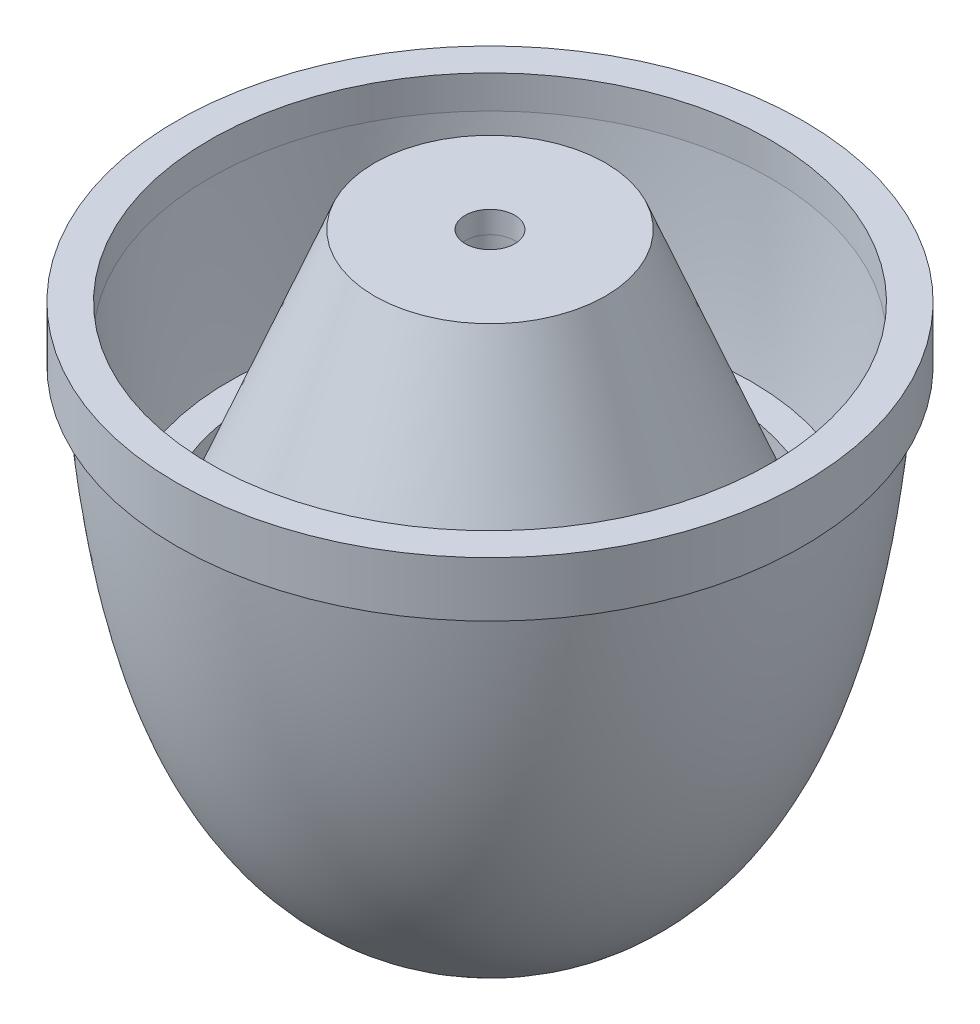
ISO-10303-21;
HEADER;
FILE_DESCRIPTION(('STEP AP214'),'2;1');
FILE_NAME('part.step','',(''),(''),'','','');
FILE_SCHEMA(('AUTOMOTIVE_DESIGN { 1 0 10303 214 1 1 1 1 }'));
ENDSEC;
DATA;
#1=APPLICATION_CONTEXT('core data for automotive mechanical design processes');
#2=APPLICATION_PROTOCOL_DEFINITION('international standard','automotive_design',2000,#1);
#3=PRODUCT_CONTEXT('',#1,'mechanical');
#4=PRODUCT('Part','Part','',(#3));
#5=PRODUCT_RELATED_PRODUCT_CATEGORY('part','',(#4));
#6=PRODUCT_DEFINITION_FORMATION('','',#4);
#7=PRODUCT_DEFINITION_CONTEXT('part definition',#1,'design');
#8=PRODUCT_DEFINITION('design','',#6,#7);
#9=PRODUCT_DEFINITION_SHAPE('','',#8);
#10=(LENGTH_UNIT() NAMED_UNIT(*) SI_UNIT(.MILLI.,.METRE.));
#11=(NAMED_UNIT(*) PLANE_ANGLE_UNIT() SI_UNIT($,.RADIAN.));
#12=(NAMED_UNIT(*) SI_UNIT($,.STERADIAN.) SOLID_ANGLE_UNIT());
#13=UNCERTAINTY_MEASURE_WITH_UNIT(LENGTH_MEASURE(1.E-05),#10,'distance_accuracy_value','');
#14=(GEOMETRIC_REPRESENTATION_CONTEXT(3) GLOBAL_UNCERTAINTY_ASSIGNED_CONTEXT((#13)) GLOBAL_UNIT_ASSIGNED_CONTEXT((#10,
#11,#12)) REPRESENTATION_CONTEXT('',''));
#15=CARTESIAN_POINT('',(0.,0.,0.));
#16=DIRECTION('',(0.,0.,1.));
#17=DIRECTION('',(1.,0.,0.));
#18=AXIS2_PLACEMENT_3D('',#15,#16,#17);
#19=CARTESIAN_POINT('',(0.,6.05139598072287,0.));
#20=DIRECTION('',(0.,1.,0.));
#21=DIRECTION('',(0.,0.,1.));
#22=AXIS2_PLACEMENT_3D('',#19,#20,#21);
#23=PLANE('',#22);
#24=CARTESIAN_POINT('',(0.,6.05139598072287,0.));
#25=DIRECTION('',(0.,-1.,0.));
#26=DIRECTION('',(0.,0.,-1.));
#27=AXIS2_PLACEMENT_3D('',#24,#25,#26);
#28=CIRCLE('',#27,4.92799404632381);
#29=CARTESIAN_POINT('',(0.,6.05139598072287,-4.92799404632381));
#30=VERTEX_POINT('',#29);
#31=EDGE_CURVE('E71',#30,#30,#28,.T.);
#32=ORIENTED_EDGE('',*,*,#31,.F.);
#33=EDGE_LOOP('',(#32));
#34=FACE_BOUND('',#33,.T.);
#35=CARTESIAN_POINT('',(0.,6.05139598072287,0.));
#36=DIRECTION('',(0.,-1.,0.));
#37=DIRECTION('',(0.,0.,-1.));
#38=AXIS2_PLACEMENT_3D('',#35,#36,#37);
#39=CIRCLE('',#38,5.83544876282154);
#40=CARTESIAN_POINT('',(0.,6.05139598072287,-5.83544876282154));
#41=VERTEX_POINT('',#40);
#42=EDGE_CURVE('E11',#41,#41,#39,.T.);
#43=ORIENTED_EDGE('',*,*,#42,.T.);
#44=EDGE_LOOP('',(#43));
#45=FACE_BOUND('',#44,.T.);
#46=ADVANCED_FACE('F52',(#34,#45),#23,.F.);
#47=CARTESIAN_POINT('',(0.,5.69518983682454,0.));
#48=DIRECTION('',(0.,-1.,0.));
#49=DIRECTION('',(0.,0.,-1.));
#50=AXIS2_PLACEMENT_3D('',#47,#48,#49);
#51=TOROIDAL_SURFACE('',#50,5.04232932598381,0.869437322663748);
#52=CARTESIAN_POINT('',(0.,6.53018884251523,0.));
#53=DIRECTION('',(0.,-1.,0.));
#54=DIRECTION('',(0.,0.,-1.));
#55=AXIS2_PLACEMENT_3D('',#52,#53,#54);
#56=CIRCLE('',#55,5.28460585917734);
#57=CARTESIAN_POINT('',(0.,6.53018884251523,-5.28460585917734));
#58=VERTEX_POINT('',#57);
#59=EDGE_CURVE('E59',#58,#58,#56,.T.);
#60=ORIENTED_EDGE('',*,*,#59,.T.);
#61=EDGE_LOOP('',(#60));
#62=FACE_BOUND('',#61,.T.);
#63=ORIENTED_EDGE('',*,*,#42,.F.);
#64=EDGE_LOOP('',(#63));
#65=FACE_BOUND('',#64,.T.);
#66=ADVANCED_FACE('F100',(#62,#65),#51,.T.);
#67=CARTESIAN_POINT('',(0.,13.1307286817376,0.));
#68=DIRECTION('',(0.,-1.,0.));
#69=DIRECTION('',(0.,0.,-1.));
#70=AXIS2_PLACEMENT_3D('',#67,#68,#69);
#71=CONICAL_SURFACE('',#70,2.667,0.377549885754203);
#72=ORIENTED_EDGE('',*,*,#59,.F.);
#73=EDGE_LOOP('',(#72));
#74=FACE_BOUND('',#73,.T.);
#75=CARTESIAN_POINT('',(0.,13.1307286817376,0.));
#76=DIRECTION('',(0.,-1.,0.));
#77=DIRECTION('',(0.,0.,-1.));
#78=AXIS2_PLACEMENT_3D('',#75,#76,#77);
#79=CIRCLE('',#78,2.667);
#80=CARTESIAN_POINT('',(0.,13.1307286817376,-2.667));
#81=VERTEX_POINT('',#80);
#82=EDGE_CURVE('E63',#81,#81,#79,.T.);
#83=ORIENTED_EDGE('',*,*,#82,.T.);
#84=EDGE_LOOP('',(#83));
#85=FACE_BOUND('',#84,.T.);
#86=ADVANCED_FACE('F105',(#74,#85),#71,.T.);
#87=CARTESIAN_POINT('',(0.,13.1307286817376,0.));
#88=DIRECTION('',(0.,-1.,0.));
#89=DIRECTION('',(0.,0.,-1.));
#90=AXIS2_PLACEMENT_3D('',#87,#88,#89);
#91=PLANE('',#90);
#92=CARTESIAN_POINT('',(0.,13.1307286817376,0.));
#93=DIRECTION('',(0.,-1.,0.));
#94=DIRECTION('',(0.,0.,-1.));
#95=AXIS2_PLACEMENT_3D('',#92,#93,#94);
#96=CIRCLE('',#95,0.5715);
#97=CARTESIAN_POINT('',(0.,13.1307286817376,-0.5715));
#98=VERTEX_POINT('',#97);
#99=EDGE_CURVE('E74',#98,#98,#96,.T.);
#100=ORIENTED_EDGE('',*,*,#99,.T.);
#101=EDGE_LOOP('',(#100));
#102=FACE_BOUND('',#101,.T.);
#103=ORIENTED_EDGE('',*,*,#82,.F.);
#104=EDGE_LOOP('',(#103));
#105=FACE_BOUND('',#104,.T.);
#106=ADVANCED_FACE('F88',(#102,#105),#91,.F.);
#107=CARTESIAN_POINT('',(0.,12.6227286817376,0.));
#108=DIRECTION('',(0.,-1.,0.));
#109=DIRECTION('',(0.,0.,-1.));
#110=AXIS2_PLACEMENT_3D('',#107,#108,#109);
#111=PLANE('',#110);
#112=CARTESIAN_POINT('',(0.,12.6227286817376,0.));
#113=DIRECTION('',(0.,-1.,0.));
#114=DIRECTION('',(0.,0.,-1.));
#115=AXIS2_PLACEMENT_3D('',#112,#113,#114);
#116=CIRCLE('',#115,0.5715);
#117=CARTESIAN_POINT('',(0.,12.6227286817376,-0.5715));
#118=VERTEX_POINT('',#117);
#119=EDGE_CURVE('E55',#118,#118,#116,.T.);
#120=ORIENTED_EDGE('',*,*,#119,.F.);
#121=EDGE_LOOP('',(#120));
#122=FACE_BOUND('',#121,.T.);
#123=CARTESIAN_POINT('',(0.,12.6227286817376,0.));
#124=DIRECTION('',(0.,-1.,0.));
#125=DIRECTION('',(0.,0.,-1.));
#126=AXIS2_PLACEMENT_3D('',#123,#124,#125);
#127=CIRCLE('',#126,2.32197099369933);
#128=CARTESIAN_POINT('',(0.,12.6227286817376,-2.32197099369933));
#129=VERTEX_POINT('',#128);
#130=EDGE_CURVE('E68',#129,#129,#127,.T.);
#131=ORIENTED_EDGE('',*,*,#130,.T.);
#132=EDGE_LOOP('',(#131));
#133=FACE_BOUND('',#132,.T.);
#134=ADVANCED_FACE('F84',(#122,#133),#111,.T.);
#135=CARTESIAN_POINT('',(0.,12.6227286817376,0.));
#136=DIRECTION('',(0.,-1.,0.));
#137=DIRECTION('',(0.,0.,-1.));
#138=AXIS2_PLACEMENT_3D('',#135,#136,#137);
#139=CONICAL_SURFACE('',#138,2.32197099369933,0.377549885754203);
#140=ORIENTED_EDGE('',*,*,#31,.T.);
#141=EDGE_LOOP('',(#140));
#142=FACE_BOUND('',#141,.T.);
#143=ORIENTED_EDGE('',*,*,#130,.F.);
#144=EDGE_LOOP('',(#143));
#145=FACE_BOUND('',#144,.T.);
#146=ADVANCED_FACE('F87',(#142,#145),#139,.F.);
#147=CARTESIAN_POINT('',(0.,-2.68214638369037,0.));
#148=DIRECTION('',(0.,-1.,0.));
#149=DIRECTION('',(0.,0.,-1.));
#150=AXIS2_PLACEMENT_3D('',#147,#148,#149);
#151=CYLINDRICAL_SURFACE('',#150,0.5715);
#152=ORIENTED_EDGE('',*,*,#119,.T.);
#153=EDGE_LOOP('',(#152));
#154=FACE_BOUND('',#153,.T.);
#155=ORIENTED_EDGE('',*,*,#99,.F.);
#156=EDGE_LOOP('',(#155));
#157=FACE_BOUND('',#156,.T.);
#158=ADVANCED_FACE('F81',(#154,#157),#151,.F.);
#159=CLOSED_SHELL('',(#46,#66,#86,#106,#134,#146,#158));
#160=MANIFOLD_SOLID_BREP('B2',#159);
#161=CARTESIAN_POINT('',(0.,10.414,-6.94911099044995));
#162=CARTESIAN_POINT('',(0.,10.2408756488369,-6.93572821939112));
#163=CARTESIAN_POINT('',(0.,9.88578309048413,-6.90658829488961));
#164=CARTESIAN_POINT('',(0.,9.24790976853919,-6.84771185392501));
#165=CARTESIAN_POINT('',(0.,8.51832643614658,-6.76858320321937));
#166=CARTESIAN_POINT('',(0.,7.72731612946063,-6.66382672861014));
#167=CARTESIAN_POINT('',(0.,6.73551549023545,-6.5051771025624));
#168=CARTESIAN_POINT('',(0.,5.54695053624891,-6.25828392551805));
#169=CARTESIAN_POINT('',(0.,4.07241499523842,-5.81863357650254));
#170=CARTESIAN_POINT('',(0.,2.53691605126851,-5.13826946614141));
#171=CARTESIAN_POINT('',(0.,1.28754004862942,-4.25736463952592));
#172=CARTESIAN_POINT('',(0.,0.427277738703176,-3.27219684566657));
#173=CARTESIAN_POINT('',(0.,-0.0985213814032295,-2.37080966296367));
#174=CARTESIAN_POINT('',(0.,-0.388807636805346,-1.46626741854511));
#175=CARTESIAN_POINT('',(0.,-0.502083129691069,-0.656928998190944));
#176=CARTESIAN_POINT('',(0.,-0.513839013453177,-0.205804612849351));
#177=CARTESIAN_POINT('',(0.,-0.507808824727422,0.0139354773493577));
#178=B_SPLINE_CURVE_WITH_KNOTS('',3,(#161,#162,#163,#164,#165,#166,#167,#168,#169,#170,#171,
#172,#173,#174,#175,#176,#177),.UNSPECIFIED.,.F.,.F.,(4,1,1,1,1,1,1,1,1,1,1,1,1,1,4),
(0.0257927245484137,0.0562367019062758,0.0866806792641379,0.147568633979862,0.208456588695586,
0.26934454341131,0.391120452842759,0.512896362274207,0.634672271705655,0.756448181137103,
0.817336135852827,0.878224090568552,0.939112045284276,0.969556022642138,1.),.UNSPECIFIED.);
#179=CARTESIAN_POINT('',(0.,0.,0.));
#180=DIRECTION('',(0.,-1.,0.));
#181=AXIS1_PLACEMENT('',#179,#180);
#182=SURFACE_OF_REVOLUTION('',#178,#181);
#183=CARTESIAN_POINT('',(0.,-0.496286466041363,0.));
#184=DIRECTION('',(0.,-1.,0.));
#185=DIRECTION('',(0.,0.,-1.));
#186=AXIS2_PLACEMENT_3D('',#183,#184,#185);
#187=CIRCLE('',#186,0.571499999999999);
#188=CARTESIAN_POINT('',(0.,-0.496286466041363,-0.571499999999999));
#189=VERTEX_POINT('',#188);
#190=EDGE_CURVE('E217',#189,#189,#187,.F.);
#191=ORIENTED_EDGE('',*,*,#190,.T.);
#192=EDGE_LOOP('',(#191));
#193=FACE_BOUND('',#192,.T.);
#194=CARTESIAN_POINT('',(0.,10.414,0.));
#195=DIRECTION('',(0.,-1.,0.));
#196=DIRECTION('',(0.,0.,-1.));
#197=AXIS2_PLACEMENT_3D('',#194,#195,#196);
#198=CIRCLE('',#197,6.94911099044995);
#199=CARTESIAN_POINT('',(0.,10.414,-6.94911099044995));
#200=VERTEX_POINT('',#199);
#201=EDGE_CURVE('E51',#200,#200,#198,.T.);
#202=ORIENTED_EDGE('',*,*,#201,.T.);
#203=EDGE_LOOP('',(#202));
#204=FACE_BOUND('',#203,.T.);
#205=ADVANCED_FACE('F170',(#193,#204),#182,.T.);
#206=CARTESIAN_POINT('',(0.,10.414,-1.80723270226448E-12));
#207=DIRECTION('',(0.,1.,0.));
#208=DIRECTION('',(0.,0.,1.));
#209=AXIS2_PLACEMENT_3D('',#206,#207,#208);
#210=PLANE('',#209);
#211=ORIENTED_EDGE('',*,*,#201,.F.);
#212=EDGE_LOOP('',(#211));
#213=FACE_BOUND('',#212,.T.);
#214=CARTESIAN_POINT('',(0.,10.414,0.));
#215=DIRECTION('',(0.,-1.,0.));
#216=DIRECTION('',(0.,0.,-1.));
#217=AXIS2_PLACEMENT_3D('',#214,#215,#216);
#218=CIRCLE('',#217,7.239);
#219=CARTESIAN_POINT('',(0.,10.414,-7.239));
#220=VERTEX_POINT('',#219);
#221=EDGE_CURVE('E178',#220,#220,#218,.T.);
#222=ORIENTED_EDGE('',*,*,#221,.T.);
#223=EDGE_LOOP('',(#222));
#224=FACE_BOUND('',#223,.T.);
#225=ADVANCED_FACE('F271',(#213,#224),#210,.F.);
#226=CARTESIAN_POINT('',(0.,0.,0.));
#227=DIRECTION('',(0.,-1.,0.));
#228=DIRECTION('',(0.,0.,-1.));
#229=AXIS2_PLACEMENT_3D('',#226,#227,#228);
#230=CYLINDRICAL_SURFACE('',#229,7.239);
#231=ORIENTED_EDGE('',*,*,#221,.F.);
#232=EDGE_LOOP('',(#231));
#233=FACE_BOUND('',#232,.T.);
#234=CARTESIAN_POINT('',(0.,11.684,0.));
#235=DIRECTION('',(0.,-1.,0.));
#236=DIRECTION('',(0.,0.,-1.));
#237=AXIS2_PLACEMENT_3D('',#234,#235,#236);
#238=CIRCLE('',#237,7.239);
#239=CARTESIAN_POINT('',(0.,11.684,-7.239));
#240=VERTEX_POINT('',#239);
#241=EDGE_CURVE('E182',#240,#240,#238,.T.);
#242=ORIENTED_EDGE('',*,*,#241,.T.);
#243=EDGE_LOOP('',(#242));
#244=FACE_BOUND('',#243,.T.);
#245=ADVANCED_FACE('F268',(#233,#244),#230,.T.);
#246=CARTESIAN_POINT('',(0.,11.684,0.));
#247=DIRECTION('',(0.,-1.,0.));
#248=DIRECTION('',(0.,0.,-1.));
#249=AXIS2_PLACEMENT_3D('',#246,#247,#248);
#250=PLANE('',#249);
#251=ORIENTED_EDGE('',*,*,#241,.F.);
#252=EDGE_LOOP('',(#251));
#253=FACE_BOUND('',#252,.T.);
#254=CARTESIAN_POINT('',(0.,11.684,0.));
#255=DIRECTION('',(0.,-1.,0.));
#256=DIRECTION('',(0.,0.,-1.));
#257=AXIS2_PLACEMENT_3D('',#254,#255,#256);
#258=CIRCLE('',#257,6.477);
#259=CARTESIAN_POINT('',(0.,11.684,-6.477));
#260=VERTEX_POINT('',#259);
#261=EDGE_CURVE('E187',#260,#260,#258,.T.);
#262=ORIENTED_EDGE('',*,*,#261,.T.);
#263=EDGE_LOOP('',(#262));
#264=FACE_BOUND('',#263,.T.);
#265=ADVANCED_FACE('F264',(#253,#264),#250,.F.);
#266=CARTESIAN_POINT('',(0.,0.,0.));
#267=DIRECTION('',(0.,-1.,0.));
#268=DIRECTION('',(0.,0.,-1.));
#269=AXIS2_PLACEMENT_3D('',#266,#267,#268);
#270=CYLINDRICAL_SURFACE('',#269,6.477);
#271=ORIENTED_EDGE('',*,*,#261,.F.);
#272=EDGE_LOOP('',(#271));
#273=FACE_BOUND('',#272,.T.);
#274=CARTESIAN_POINT('',(0.,10.922,0.));
#275=DIRECTION('',(0.,-1.,0.));
#276=DIRECTION('',(0.,0.,-1.));
#277=AXIS2_PLACEMENT_3D('',#274,#275,#276);
#278=CIRCLE('',#277,6.477);
#279=CARTESIAN_POINT('',(0.,10.922,-6.477));
#280=VERTEX_POINT('',#279);
#281=EDGE_CURVE('E190',#280,#280,#278,.T.);
#282=ORIENTED_EDGE('',*,*,#281,.T.);
#283=EDGE_LOOP('',(#282));
#284=FACE_BOUND('',#283,.T.);
#285=ADVANCED_FACE('F261',(#273,#284),#270,.F.);
#286=CARTESIAN_POINT('',(0.,10.922,-6.477));
#287=CARTESIAN_POINT('',(0.,6.21658519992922,-6.14997408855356));
#288=CARTESIAN_POINT('',(0.,5.842,-5.66074646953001));
#289=CARTESIAN_POINT('',(0.,-0.141924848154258,-5.1717417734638));
#290=CARTESIAN_POINT('',(0.,0.,0.));
#291=B_SPLINE_CURVE_WITH_KNOTS('',4,(#286,#287,#288,#289,#290),.UNSPECIFIED.,.F.,.F.,(5,5),(0.,
1.),.UNSPECIFIED.);
#292=CARTESIAN_POINT('',(0.,0.,0.));
#293=DIRECTION('',(0.,-1.,0.));
#294=AXIS1_PLACEMENT('',#292,#293);
#295=SURFACE_OF_REVOLUTION('',#291,#294);
#296=CARTESIAN_POINT('',(0.,7.0673959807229,0.));
#297=DIRECTION('',(0.,-1.,0.));
#298=DIRECTION('',(0.,0.,-1.));
#299=AXIS2_PLACEMENT_3D('',#296,#297,#298);
#300=CIRCLE('',#299,6.03996542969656);
#301=CARTESIAN_POINT('',(0.,7.0673959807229,-6.03996542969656));
#302=VERTEX_POINT('',#301);
#303=EDGE_CURVE('E193',#302,#302,#300,.T.);
#304=ORIENTED_EDGE('',*,*,#303,.T.);
#305=EDGE_LOOP('',(#304));
#306=FACE_BOUND('',#305,.T.);
#307=ORIENTED_EDGE('',*,*,#281,.F.);
#308=EDGE_LOOP('',(#307));
#309=FACE_BOUND('',#308,.T.);
#310=ADVANCED_FACE('F236',(#306,#309),#295,.F.);
#311=CARTESIAN_POINT('',(0.,7.06739598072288,0.));
#312=DIRECTION('',(0.,-1.,0.));
#313=DIRECTION('',(0.,0.,-1.));
#314=AXIS2_PLACEMENT_3D('',#311,#312,#313);
#315=PLANE('',#314);
#316=ORIENTED_EDGE('',*,*,#303,.F.);
#317=EDGE_LOOP('',(#316));
#318=FACE_BOUND('',#317,.T.);
#319=CARTESIAN_POINT('',(0.,7.06739598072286,0.));
#320=DIRECTION('',(0.,-1.,0.));
#321=DIRECTION('',(0.,0.,-1.));
#322=AXIS2_PLACEMENT_3D('',#319,#320,#321);
#323=CIRCLE('',#322,5.36867326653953);
#324=CARTESIAN_POINT('',(0.,7.06739598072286,-5.36867326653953));
#325=VERTEX_POINT('',#324);
#326=EDGE_CURVE('E196',#325,#325,#323,.T.);
#327=ORIENTED_EDGE('',*,*,#326,.T.);
#328=EDGE_LOOP('',(#327));
#329=FACE_BOUND('',#328,.T.);
#330=ADVANCED_FACE('F256',(#318,#329),#315,.F.);
#331=CARTESIAN_POINT('',(0.,0.,0.));
#332=DIRECTION('',(0.,-1.,0.));
#333=DIRECTION('',(0.,0.,-1.));
#334=AXIS2_PLACEMENT_3D('',#331,#332,#333);
#335=CYLINDRICAL_SURFACE('',#334,5.36867326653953);
#336=ORIENTED_EDGE('',*,*,#326,.F.);
#337=EDGE_LOOP('',(#336));
#338=FACE_BOUND('',#337,.T.);
#339=CARTESIAN_POINT('',(0.,6.55939598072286,0.));
#340=DIRECTION('',(0.,-1.,0.));
#341=DIRECTION('',(0.,0.,-1.));
#342=AXIS2_PLACEMENT_3D('',#339,#340,#341);
#343=CIRCLE('',#342,5.36867326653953);
#344=CARTESIAN_POINT('',(0.,6.55939598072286,-5.36867326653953));
#345=VERTEX_POINT('',#344);
#346=EDGE_CURVE('E199',#345,#345,#343,.T.);
#347=ORIENTED_EDGE('',*,*,#346,.T.);
#348=EDGE_LOOP('',(#347));
#349=FACE_BOUND('',#348,.T.);
#350=ADVANCED_FACE('F252',(#338,#349),#335,.F.);
#351=CARTESIAN_POINT('',(0.,6.55939598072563,0.));
#352=DIRECTION('',(0.,1.,0.));
#353=DIRECTION('',(0.,0.,1.));
#354=AXIS2_PLACEMENT_3D('',#351,#352,#353);
#355=PLANE('',#354);
#356=ORIENTED_EDGE('',*,*,#346,.F.);
#357=EDGE_LOOP('',(#356));
#358=FACE_BOUND('',#357,.T.);
#359=CARTESIAN_POINT('',(0.,6.55939598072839,0.));
#360=DIRECTION('',(0.,-1.,0.));
#361=DIRECTION('',(0.,0.,-1.));
#362=AXIS2_PLACEMENT_3D('',#359,#360,#361);
#363=CIRCLE('',#362,5.94444249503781);
#364=CARTESIAN_POINT('',(0.,6.55939598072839,-5.94444249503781));
#365=VERTEX_POINT('',#364);
#366=EDGE_CURVE('E202',#365,#365,#363,.T.);
#367=ORIENTED_EDGE('',*,*,#366,.T.);
#368=EDGE_LOOP('',(#367));
#369=FACE_BOUND('',#368,.T.);
#370=ADVANCED_FACE('F249',(#358,#369),#355,.F.);
#371=CARTESIAN_POINT('',(0.,6.05139598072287,0.));
#372=DIRECTION('',(0.,-1.,0.));
#373=DIRECTION('',(0.,0.,-1.));
#374=AXIS2_PLACEMENT_3D('',#371,#372,#373);
#375=CIRCLE('',#374,5.83544876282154);
#376=CARTESIAN_POINT('',(0.,6.05139598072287,-5.83544876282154));
#377=VERTEX_POINT('',#376);
#378=EDGE_CURVE('E205',#377,#377,#375,.T.);
#379=ORIENTED_EDGE('',*,*,#378,.T.);
#380=EDGE_LOOP('',(#379));
#381=FACE_BOUND('',#380,.T.);
#382=ORIENTED_EDGE('',*,*,#366,.F.);
#383=EDGE_LOOP('',(#382));
#384=FACE_BOUND('',#383,.T.);
#385=ADVANCED_FACE('F237',(#381,#384),#295,.F.);
#386=CARTESIAN_POINT('',(0.,6.05139598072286,0.));
#387=DIRECTION('',(0.,1.,0.));
#388=DIRECTION('',(0.,0.,1.));
#389=AXIS2_PLACEMENT_3D('',#386,#387,#388);
#390=PLANE('',#389);
#391=CARTESIAN_POINT('',(0.,6.05139598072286,0.));
#392=DIRECTION('',(0.,-1.,0.));
#393=DIRECTION('',(0.,0.,-1.));
#394=AXIS2_PLACEMENT_3D('',#391,#392,#393);
#395=CIRCLE('',#394,5.36867326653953);
#396=CARTESIAN_POINT('',(0.,6.05139598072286,-5.36867326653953));
#397=VERTEX_POINT('',#396);
#398=EDGE_CURVE('E208',#397,#397,#395,.T.);
#399=ORIENTED_EDGE('',*,*,#398,.T.);
#400=EDGE_LOOP('',(#399));
#401=FACE_BOUND('',#400,.T.);
#402=ORIENTED_EDGE('',*,*,#378,.F.);
#403=EDGE_LOOP('',(#402));
#404=FACE_BOUND('',#403,.T.);
#405=ADVANCED_FACE('F244',(#401,#404),#390,.T.);
#406=CARTESIAN_POINT('',(0.,0.,0.));
#407=DIRECTION('',(0.,-1.,0.));
#408=DIRECTION('',(0.,0.,-1.));
#409=AXIS2_PLACEMENT_3D('',#406,#407,#408);
#410=CYLINDRICAL_SURFACE('',#409,5.36867326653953);
#411=CARTESIAN_POINT('',(0.,5.54339598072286,0.));
#412=DIRECTION('',(0.,-1.,0.));
#413=DIRECTION('',(0.,0.,-1.));
#414=AXIS2_PLACEMENT_3D('',#411,#412,#413);
#415=CIRCLE('',#414,5.36867326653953);
#416=CARTESIAN_POINT('',(0.,5.54339598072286,-5.36867326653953));
#417=VERTEX_POINT('',#416);
#418=EDGE_CURVE('E211',#417,#417,#415,.T.);
#419=ORIENTED_EDGE('',*,*,#418,.T.);
#420=EDGE_LOOP('',(#419));
#421=FACE_BOUND('',#420,.T.);
#422=ORIENTED_EDGE('',*,*,#398,.F.);
#423=EDGE_LOOP('',(#422));
#424=FACE_BOUND('',#423,.T.);
#425=ADVANCED_FACE('F240',(#421,#424),#410,.F.);
#426=CARTESIAN_POINT('',(0.,5.54339598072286,0.));
#427=DIRECTION('',(0.,-1.,0.));
#428=DIRECTION('',(0.,0.,-1.));
#429=AXIS2_PLACEMENT_3D('',#426,#427,#428);
#430=PLANE('',#429);
#431=CARTESIAN_POINT('',(0.,5.54339598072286,0.));
#432=DIRECTION('',(0.,-1.,0.));
#433=DIRECTION('',(0.,0.,-1.));
#434=AXIS2_PLACEMENT_3D('',#431,#432,#433);
#435=CIRCLE('',#434,5.7109490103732);
#436=CARTESIAN_POINT('',(0.,5.54339598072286,-5.7109490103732));
#437=VERTEX_POINT('',#436);
#438=EDGE_CURVE('E214',#437,#437,#435,.T.);
#439=ORIENTED_EDGE('',*,*,#438,.T.);
#440=EDGE_LOOP('',(#439));
#441=FACE_BOUND('',#440,.T.);
#442=ORIENTED_EDGE('',*,*,#418,.F.);
#443=EDGE_LOOP('',(#442));
#444=FACE_BOUND('',#443,.T.);
#445=ADVANCED_FACE('F234',(#441,#444),#430,.T.);
#446=CARTESIAN_POINT('',(0.,0.0129232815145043,0.));
#447=DIRECTION('',(0.,-1.,0.));
#448=DIRECTION('',(0.,0.,-1.));
#449=AXIS2_PLACEMENT_3D('',#446,#447,#448);
#450=CIRCLE('',#449,0.571499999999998);
#451=CARTESIAN_POINT('',(0.,0.0129232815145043,-0.571499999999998));
#452=VERTEX_POINT('',#451);
#453=EDGE_CURVE('E174',#452,#452,#450,.F.);
#454=ORIENTED_EDGE('',*,*,#453,.F.);
#455=EDGE_LOOP('',(#454));
#456=FACE_BOUND('',#455,.T.);
#457=ORIENTED_EDGE('',*,*,#438,.F.);
#458=EDGE_LOOP('',(#457));
#459=FACE_BOUND('',#458,.T.);
#460=ADVANCED_FACE('F229',(#456,#459),#295,.F.);
#461=CARTESIAN_POINT('',(0.,-2.68214638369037,0.));
#462=DIRECTION('',(0.,-1.,0.));
#463=DIRECTION('',(0.,0.,-1.));
#464=AXIS2_PLACEMENT_3D('',#461,#462,#463);
#465=CYLINDRICAL_SURFACE('',#464,0.5715);
#466=ORIENTED_EDGE('',*,*,#453,.T.);
#467=EDGE_LOOP('',(#466));
#468=FACE_BOUND('',#467,.T.);
#469=ORIENTED_EDGE('',*,*,#190,.F.);
#470=EDGE_LOOP('',(#469));
#471=FACE_BOUND('',#470,.T.);
#472=ADVANCED_FACE('F233',(#468,#471),#465,.F.);
#473=CLOSED_SHELL('',(#205,#225,#245,#265,#285,#310,#330,#350,#370,#385,#405,#425,#445,#460,#472));
#474=MANIFOLD_SOLID_BREP('B6',#473);
#475=CARTESIAN_POINT('',(0.,12.6227286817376,0.));
#476=DIRECTION('',(0.,1.,0.));
#477=DIRECTION('',(0.,0.,1.));
#478=AXIS2_PLACEMENT_3D('',#475,#476,#477);
#479=CYLINDRICAL_SURFACE('',#478,1.99058744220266);
#480=CARTESIAN_POINT('',(0.,4.34418892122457,0.));
#481=DIRECTION('',(0.,1.,0.));
#482=DIRECTION('',(0.,0.,1.));
#483=AXIS2_PLACEMENT_3D('',#480,#481,#482);
#484=CIRCLE('',#483,1.99058744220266);
#485=CARTESIAN_POINT('',(0.,4.34418892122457,1.99058744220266));
#486=VERTEX_POINT('',#485);
#487=EDGE_CURVE('E169',#486,#486,#484,.T.);
#488=ORIENTED_EDGE('',*,*,#487,.F.);
#489=EDGE_LOOP('',(#488));
#490=FACE_BOUND('',#489,.T.);
#491=CARTESIAN_POINT('',(0.,6.40873465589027,0.));
#492=DIRECTION('',(0.,1.,0.));
#493=DIRECTION('',(0.,0.,1.));
#494=AXIS2_PLACEMENT_3D('',#491,#492,#493);
#495=CIRCLE('',#494,1.99058744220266);
#496=CARTESIAN_POINT('',(0.,6.40873465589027,1.99058744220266));
#497=VERTEX_POINT('',#496);
#498=EDGE_CURVE('E442',#497,#497,#495,.T.);
#499=ORIENTED_EDGE('',*,*,#498,.T.);
#500=EDGE_LOOP('',(#499));
#501=FACE_BOUND('',#500,.T.);
#502=ADVANCED_FACE('F419',(#490,#501),#479,.F.);
#503=CARTESIAN_POINT('',(0.,4.34418892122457,0.));
#504=DIRECTION('',(0.,1.,0.));
#505=DIRECTION('',(0.,0.,1.));
#506=AXIS2_PLACEMENT_3D('',#503,#504,#505);
#507=TOROIDAL_SURFACE('',#506,2.156279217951,0.165691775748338);
#508=CARTESIAN_POINT('',(0.,4.34418892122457,0.));
#509=DIRECTION('',(0.,1.,0.));
#510=DIRECTION('',(0.,0.,1.));
#511=AXIS2_PLACEMENT_3D('',#508,#509,#510);
#512=CIRCLE('',#511,2.32197099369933);
#513=CARTESIAN_POINT('',(0.,4.34418892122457,2.32197099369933));
#514=VERTEX_POINT('',#513);
#515=EDGE_CURVE('E426',#514,#514,#512,.T.);
#516=ORIENTED_EDGE('',*,*,#515,.F.);
#517=EDGE_LOOP('',(#516));
#518=FACE_BOUND('',#517,.T.);
#519=ORIENTED_EDGE('',*,*,#487,.T.);
#520=EDGE_LOOP('',(#519));
#521=FACE_BOUND('',#520,.T.);
#522=ADVANCED_FACE('F515',(#518,#521),#507,.T.);
#523=CARTESIAN_POINT('',(0.,12.6227286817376,0.));
#524=DIRECTION('',(0.,1.,0.));
#525=DIRECTION('',(0.,0.,1.));
#526=AXIS2_PLACEMENT_3D('',#523,#524,#525);
#527=CYLINDRICAL_SURFACE('',#526,2.32197099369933);
#528=CARTESIAN_POINT('',(-2.32190491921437,10.7621571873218,-0.0175168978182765));
#529=CARTESIAN_POINT('',(-2.32190697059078,10.816123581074,-0.0175121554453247));
#530=CARTESIAN_POINT('',(-2.32195797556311,10.8701430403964,-0.0126107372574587));
#531=CARTESIAN_POINT('',(-2.32198024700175,10.9764967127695,0.00669888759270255));
#532=CARTESIAN_POINT('',(-2.3219513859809,11.0288280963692,0.0211222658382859));
#533=CARTESIAN_POINT('',(-2.32130743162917,11.1300520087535,0.0585318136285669));
#534=CARTESIAN_POINT('',(-2.32069484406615,11.1789582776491,0.0814811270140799));
#535=CARTESIAN_POINT('',(-2.31820957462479,11.2724916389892,0.134766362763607));
#536=CARTESIAN_POINT('',(-2.31633689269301,11.3171187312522,0.165102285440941));
#537=CARTESIAN_POINT('',(-2.31045963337,11.4035541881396,0.233587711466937));
#538=CARTESIAN_POINT('',(-2.30635044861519,11.4450998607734,0.272058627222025));
#539=CARTESIAN_POINT('',(-2.29516489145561,11.5221614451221,0.35424302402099));
#540=CARTESIAN_POINT('',(-2.28808740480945,11.5576750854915,0.397958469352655));
#541=CARTESIAN_POINT('',(-2.26929108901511,11.6261169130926,0.494524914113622));
#542=CARTESIAN_POINT('',(-2.2571272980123,11.658260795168,0.547846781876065));
#543=CARTESIAN_POINT('',(-2.22770527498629,11.7143233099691,0.65733950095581));
#544=CARTESIAN_POINT('',(-2.21044526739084,11.7382390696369,0.713511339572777));
#545=CARTESIAN_POINT('',(-2.1694239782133,11.778781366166,0.830170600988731));
#546=CARTESIAN_POINT('',(-2.14534625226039,11.7949103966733,0.890720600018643));
#547=CARTESIAN_POINT('',(-2.09135461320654,11.8176034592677,1.01100571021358));
#548=CARTESIAN_POINT('',(-2.06144036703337,11.8241669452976,1.07074077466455));
#549=CARTESIAN_POINT('',(-1.99617304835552,11.8276840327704,1.18801347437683));
#550=CARTESIAN_POINT('',(-1.96078327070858,11.8245698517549,1.24553274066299));
#551=CARTESIAN_POINT('',(-1.88582899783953,11.808610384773,1.35634566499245));
#552=CARTESIAN_POINT('',(-1.84626440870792,11.795764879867,1.40963922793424));
#553=CARTESIAN_POINT('',(-1.7645213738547,11.7604663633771,1.51070719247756));
#554=CARTESIAN_POINT('',(-1.72234436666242,11.73801859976,1.55848459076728));
#555=CARTESIAN_POINT('',(-1.63726647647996,11.6837109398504,1.6476364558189));
#556=CARTESIAN_POINT('',(-1.59436549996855,11.6518498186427,1.68901008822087));
#557=CARTESIAN_POINT('',(-1.51017210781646,11.5790825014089,1.76468987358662));
#558=CARTESIAN_POINT('',(-1.46887729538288,11.5381904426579,1.79900691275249));
#559=CARTESIAN_POINT('',(-1.39039680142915,11.4478240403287,1.86033029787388));
#560=CARTESIAN_POINT('',(-1.35321073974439,11.3983504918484,1.8873373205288));
#561=CARTESIAN_POINT('',(-1.28743723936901,11.2943280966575,1.93276461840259));
#562=CARTESIAN_POINT('',(-1.25851773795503,11.2401467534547,1.95154081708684));
#563=CARTESIAN_POINT('',(-1.209462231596,11.1261765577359,1.98232141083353));
#564=CARTESIAN_POINT('',(-1.18931555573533,11.0663946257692,1.99433403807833));
#565=CARTESIAN_POINT('',(-1.16163053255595,10.9507337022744,2.01056965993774));
#566=CARTESIAN_POINT('',(-1.15286279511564,10.8952560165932,2.01555853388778));
#567=CARTESIAN_POINT('',(-1.14448346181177,10.7834010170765,2.02033013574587));
#568=CARTESIAN_POINT('',(-1.14486641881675,10.7270242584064,2.02011596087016));
#569=CARTESIAN_POINT('',(-1.15427235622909,10.6205828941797,2.01475200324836));
#570=CARTESIAN_POINT('',(-1.16248616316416,10.5704199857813,2.010064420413));
#571=CARTESIAN_POINT('',(-1.18577141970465,10.4723282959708,1.99641576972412));
#572=CARTESIAN_POINT('',(-1.2008434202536,10.4243996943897,1.98745435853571));
#573=CARTESIAN_POINT('',(-1.23731691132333,10.3306310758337,1.96495902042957));
#574=CARTESIAN_POINT('',(-1.25887656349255,10.2848809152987,1.95130946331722));
#575=CARTESIAN_POINT('',(-1.30685121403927,10.197706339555,1.91950933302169));
#576=CARTESIAN_POINT('',(-1.33326800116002,10.1562835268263,1.90135710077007));
#577=CARTESIAN_POINT('',(-1.39273261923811,10.0739890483,1.85831467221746));
#578=CARTESIAN_POINT('',(-1.42619096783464,10.0336883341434,1.83290038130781));
#579=CARTESIAN_POINT('',(-1.49565974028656,9.95958005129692,1.77666823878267));
#580=CARTESIAN_POINT('',(-1.53167136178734,9.92577555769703,1.7458478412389));
#581=CARTESIAN_POINT('',(-1.60851343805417,9.86172228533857,1.6754769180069));
#582=CARTESIAN_POINT('',(-1.64944906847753,9.83223401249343,1.63534652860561));
#583=CARTESIAN_POINT('',(-1.73052206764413,9.78183948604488,1.5493029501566));
#584=CARTESIAN_POINT('',(-1.77065923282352,9.7609353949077,1.50338830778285));
#585=CARTESIAN_POINT('',(-1.85023643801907,9.72713867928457,1.40441483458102));
#586=CARTESIAN_POINT('',(-1.88956429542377,9.71464783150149,1.35112781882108));
#587=CARTESIAN_POINT('',(-1.96403016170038,9.69933966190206,1.24039816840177));
#588=CARTESIAN_POINT('',(-1.99916797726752,9.69652278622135,1.18295534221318));
#589=CARTESIAN_POINT('',(-2.06425208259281,9.70059229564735,1.0653361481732));
#590=CARTESIAN_POINT('',(-2.09418495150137,9.70750335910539,1.00515320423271));
#591=CARTESIAN_POINT('',(-2.14812472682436,9.73101228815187,0.884028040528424));
#592=CARTESIAN_POINT('',(-2.17213146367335,9.74761043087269,0.823085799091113));
#593=CARTESIAN_POINT('',(-2.21409452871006,9.79035960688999,0.70243664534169));
#594=CARTESIAN_POINT('',(-2.23204730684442,9.81651622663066,0.642730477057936));
#595=CARTESIAN_POINT('',(-2.26222546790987,9.87814995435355,0.52676061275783));
#596=CARTESIAN_POINT('',(-2.27445016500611,9.91362817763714,0.47049732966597));
#597=CARTESIAN_POINT('',(-2.2938869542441,9.99328664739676,0.36406436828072));
#598=CARTESIAN_POINT('',(-2.30112922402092,10.0374123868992,0.313859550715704));
#599=CARTESIAN_POINT('',(-2.31184455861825,10.1339122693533,0.221556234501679));
#600=CARTESIAN_POINT('',(-2.31531760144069,10.1862864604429,0.179457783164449));
#601=CARTESIAN_POINT('',(-2.31970446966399,10.2945868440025,0.108243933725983));
#602=CARTESIAN_POINT('',(-2.32076742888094,10.3500732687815,0.078471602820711));
#603=CARTESIAN_POINT('',(-2.32190132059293,10.4657019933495,0.0302665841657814));
#604=CARTESIAN_POINT('',(-2.32197516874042,10.5258300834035,0.0118007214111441));
#605=CARTESIAN_POINT('',(-2.32196899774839,10.6159398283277,-0.00602551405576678));
#606=CARTESIAN_POINT('',(-2.32194978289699,10.6450097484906,-0.0103247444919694));
#607=CARTESIAN_POINT('',(-2.32191718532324,10.7034335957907,-0.0160717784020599));
#608=CARTESIAN_POINT('',(-2.3219038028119,10.7327875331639,-0.0175194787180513));
#609=CARTESIAN_POINT('',(-2.32190491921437,10.7621571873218,-0.0175168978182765));
#610=B_SPLINE_CURVE_WITH_KNOTS('',3,(#528,#529,#530,#531,#532,#533,#534,#535,#536,#537,#538,
#539,#540,#541,#542,#543,#544,#545,#546,#547,#548,#549,#550,#551,#552,#553,#554,#555,#556,#557,
#558,#559,#560,#561,#562,#563,#564,#565,#566,#567,#568,#569,#570,#571,#572,#573,#574,#575,#576,
#577,#578,#579,#580,#581,#582,#583,#584,#585,#586,#587,#588,#589,#590,#591,#592,#593,#594,#595,
#596,#597,#598,#599,#600,#601,#602,#603,#604,#605,#606,#607,#608,#609),.UNSPECIFIED.,.T.,.F.,(4,
2,2,2,2,2,2,2,2,2,2,2,2,2,2,2,2,2,2,2,2,2,2,2,2,2,2,2,2,2,2,2,2,2,2,2,2,2,2,2,4),(0.,
0.16177619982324,0.323810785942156,0.48515292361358,0.646495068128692,0.816128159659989,
0.98582498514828,1.17530867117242,1.36485845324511,1.56529421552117,1.76574141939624,
1.96759571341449,2.16945454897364,2.37120320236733,2.57297811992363,2.77443938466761,
2.97588199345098,3.16745334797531,3.35879102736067,3.52700776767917,3.6951243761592,
3.84756099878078,4.00000986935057,4.15652661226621,4.31310111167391,4.48704580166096,
4.66107262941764,4.85360746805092,5.0461907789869,5.24741950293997,5.44865750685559,
5.65040694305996,5.85216215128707,6.05403546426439,6.2559329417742,6.45659653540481,
6.65726130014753,6.84512435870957,7.03243352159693,7.12047237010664,7.20851440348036),.UNSPECIFIED.);
#611=CARTESIAN_POINT('',(-2.32190491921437,10.7621571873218,-0.0175168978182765));
#612=VERTEX_POINT('',#611);
#613=EDGE_CURVE('E443',#612,#612,#610,.T.);
#614=ORIENTED_EDGE('',*,*,#613,.T.);
#615=EDGE_LOOP('',(#614));
#616=FACE_BOUND('',#615,.T.);
#617=CARTESIAN_POINT('',(1.14578238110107,10.7621571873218,2.01958709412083));
#618=CARTESIAN_POINT('',(1.14578751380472,10.816123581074,2.01958649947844));
#619=CARTESIAN_POINT('',(1.15005776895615,10.8701430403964,2.01717996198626));
#620=CARTESIAN_POINT('',(1.16679153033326,10.9764967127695,2.00754443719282));
#621=CARTESIAN_POINT('',(1.1792681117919,11.0288280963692,2.0003077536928));
#622=CARTESIAN_POINT('',(1.21134375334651,11.1300520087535,1.98104529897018));
#623=CARTESIAN_POINT('',(1.23091214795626,11.1789582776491,1.9690401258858));
#624=CARTESIAN_POINT('',(1.27581588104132,11.2724916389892,1.94024520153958));
#625=CARTESIAN_POINT('',(1.30115121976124,11.3171187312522,1.92345545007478));
#626=CARTESIAN_POINT('',(1.35752270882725,11.4035541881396,1.88412288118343));
#627=CARTESIAN_POINT('',(1.3887849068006,11.4450998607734,1.86132876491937));
#628=CARTESIAN_POINT('',(1.45436590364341,11.5221614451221,1.81054958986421));
#629=CARTESIAN_POINT('',(1.4886858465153,11.5576750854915,1.78256258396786));
#630=CARTESIAN_POINT('',(1.56291668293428,11.6261169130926,1.71800127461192));
#631=CARTESIAN_POINT('',(1.60301287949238,11.658260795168,1.68080618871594));
#632=CARTESIAN_POINT('',(1.68312534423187,11.7143233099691,1.60057960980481));
#633=CARTESIAN_POINT('',(1.72314157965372,11.7382390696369,1.55754608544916));
#634=CARTESIAN_POINT('',(1.80366081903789,11.778781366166,1.46369097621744));
#635=CARTESIAN_POINT('',(1.84405979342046,11.7949103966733,1.4125640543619));
#636=CARTESIAN_POINT('',(1.92123393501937,11.8176034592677,1.30566336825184));
#637=CARTESIAN_POINT('',(1.95800889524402,11.8241669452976,1.24988933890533));
#638=CARTESIAN_POINT('',(2.02693637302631,11.8276840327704,1.13472983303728));
#639=CARTESIAN_POINT('',(2.0590546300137,11.8245698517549,1.07532175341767));
#640=CARTESIAN_POINT('',(2.11754430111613,11.808610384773,0.955002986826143));
#641=CARTESIAN_POINT('',(2.1439155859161,11.795764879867,0.89409226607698));
#642=CARTESIAN_POINT('',(2.19057149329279,11.7604663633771,0.772766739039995));
#643=CARTESIAN_POINT('',(2.21085943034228,11.73801859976,0.712351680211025));
#644=CARTESIAN_POINT('',(2.24552826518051,11.6837109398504,0.594096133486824));
#645=CARTESIAN_POINT('',(2.25990839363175,11.6518498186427,0.536255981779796));
#646=CARTESIAN_POINT('',(2.2833523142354,11.5790825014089,0.425502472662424));
#647=CARTESIAN_POINT('',(2.29242433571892,11.5381904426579,0.372581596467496));
#648=CARTESIAN_POINT('',(2.30629169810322,11.4478240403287,0.273953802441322));
#649=CARTESIAN_POINT('',(2.31108743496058,11.3983504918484,0.228246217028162));
#650=CARTESIAN_POINT('',(2.31754187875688,11.2943280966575,0.148571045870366));
#651=CARTESIAN_POINT('',(2.31934279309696,11.2401467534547,0.114137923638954));
#652=CARTESIAN_POINT('',(2.32147181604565,11.1261765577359,0.0562643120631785));
#653=CARTESIAN_POINT('',(2.3218017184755,11.0663946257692,0.0328104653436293));
#654=CARTESIAN_POINT('',(2.3220196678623,10.9507337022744,0.000716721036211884));
#655=CARTESIAN_POINT('',(2.32195629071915,10.8952560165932,-0.00937079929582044));
#656=CARTESIAN_POINT('',(2.32189895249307,10.7834010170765,-0.0190133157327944));
#657=CARTESIAN_POINT('',(2.32190495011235,10.7270242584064,-0.0185745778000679));
#658=CARTESIAN_POINT('',(2.32196259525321,10.6205828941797,-0.00774681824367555));
#659=CARTESIAN_POINT('',(2.32200993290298,10.5704199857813,0.00171033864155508));
#660=CARTESIAN_POINT('',(2.32183248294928,10.4723282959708,0.0287002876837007));
#661=CARTESIAN_POINT('',(2.32160767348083,10.4243996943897,0.0462337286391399));
#662=CARTESIAN_POINT('',(2.32036288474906,10.3306310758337,0.0890683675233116));
#663=CARTESIAN_POINT('',(2.31932184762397,10.2848809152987,0.114564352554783));
#664=CARTESIAN_POINT('',(2.31576945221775,10.197706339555,0.172011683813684));
#665=CARTESIAN_POINT('',(2.31325755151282,10.1562835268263,0.203965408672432));
#666=CARTESIAN_POINT('',(2.30571402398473,10.0739890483,0.276984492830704));
#667=CARTESIAN_POINT('',(2.30043377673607,10.0336883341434,0.318667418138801));
#668=CARTESIAN_POINT('',(2.28646969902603,9.95958005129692,0.406945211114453));
#669=CARTESIAN_POINT('',(2.27778426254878,9.92577555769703,0.45354238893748));
#670=CARTESIAN_POINT('',(2.25526229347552,9.86172228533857,0.555275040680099));
#671=CARTESIAN_POINT('',(2.24097617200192,9.83223401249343,0.610791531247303));
#672=CARTESIAN_POINT('',(2.20699674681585,9.78183948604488,0.72402459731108));
#673=CARTESIAN_POINT('',(2.18730208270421,9.7609353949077,0.781741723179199));
#674=CARTESIAN_POINT('',(2.14137714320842,9.72713867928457,0.900144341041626));
#675=CARTESIAN_POINT('',(2.1148931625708,9.71464783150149,0.960846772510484));
#676=CARTESIAN_POINT('',(2.05623140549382,9.69933966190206,1.08070092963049));
#677=CARTESIAN_POINT('',(2.02405336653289,9.69652278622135,1.13985258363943));
#678=CARTESIAN_POINT('',(1.95473420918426,9.70059229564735,1.2550266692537));
#679=CARTESIAN_POINT('',(1.91758068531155,9.70750335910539,1.31104076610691));
#680=CARTESIAN_POINT('',(1.83965310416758,9.73101228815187,1.41831656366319));
#681=CARTESIAN_POINT('',(1.7988789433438,9.74761043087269,1.46957812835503));
#682=CARTESIAN_POINT('',(1.71537524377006,9.79035960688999,1.56624378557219));
#683=CARTESIAN_POINT('',(1.67264457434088,9.81651622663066,1.61164443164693));
#684=CARTESIAN_POINT('',(1.58730080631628,9.87814995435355,1.69576441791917));
#685=CARTESIAN_POINT('',(1.54468772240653,9.91362817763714,1.734482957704));
#686=CARTESIAN_POINT('',(1.4622324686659,9.99328664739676,1.80453219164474));
#687=CARTESIAN_POINT('',(1.42237495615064,10.0374123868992,1.83590659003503));
#688=CARTESIAN_POINT('',(1.34779560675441,10.1339122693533,1.89133800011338));
#689=CARTESIAN_POINT('',(1.31307379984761,10.1862864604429,1.91539496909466));
#690=CARTESIAN_POINT('',(1.25359423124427,10.2945868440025,1.95480103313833));
#691=CARTESIAN_POINT('',(1.2283421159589,10.3500732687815,1.97060774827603));
#692=CARTESIAN_POINT('',(1.18716229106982,10.4657019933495,1.99569223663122));
#693=CARTESIAN_POINT('',(1.17120730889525,10.5258300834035,2.00498912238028));
#694=CARTESIAN_POINT('',(1.15576625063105,10.6159398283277,2.01389689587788));
#695=CARTESIAN_POINT('',(1.15203340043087,10.6450097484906,2.01602987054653));
#696=CARTESIAN_POINT('',(1.14704002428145,10.7034335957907,2.01887515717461));
#697=CARTESIAN_POINT('',(1.14577958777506,10.7327875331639,2.01958741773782));
#698=CARTESIAN_POINT('',(1.14578238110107,10.7621571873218,2.01958709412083));
#699=B_SPLINE_CURVE_WITH_KNOTS('',3,(#617,#618,#619,#620,#621,#622,#623,#624,#625,#626,#627,
#628,#629,#630,#631,#632,#633,#634,#635,#636,#637,#638,#639,#640,#641,#642,#643,#644,#645,#646,
#647,#648,#649,#650,#651,#652,#653,#654,#655,#656,#657,#658,#659,#660,#661,#662,#663,#664,#665,
#666,#667,#668,#669,#670,#671,#672,#673,#674,#675,#676,#677,#678,#679,#680,#681,#682,#683,#684,
#685,#686,#687,#688,#689,#690,#691,#692,#693,#694,#695,#696,#697,#698),.UNSPECIFIED.,.T.,.F.,(4,
2,2,2,2,2,2,2,2,2,2,2,2,2,2,2,2,2,2,2,2,2,2,2,2,2,2,2,2,2,2,2,2,2,2,2,2,2,2,2,4),(0.,
0.16177619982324,0.323810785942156,0.485152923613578,0.646495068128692,0.816128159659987,
0.98582498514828,1.17530867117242,1.36485845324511,1.56529421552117,1.76574141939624,
1.96759571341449,2.16945454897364,2.37120320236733,2.57297811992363,2.77443938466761,
2.97588199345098,3.16745334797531,3.35879102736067,3.52700776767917,3.6951243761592,
3.84756099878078,4.00000986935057,4.15652661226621,4.31310111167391,4.48704580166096,
4.66107262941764,4.85360746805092,5.0461907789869,5.24741950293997,5.44865750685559,
5.65040694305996,5.85216215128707,6.05403546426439,6.2559329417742,6.45659653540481,
6.65726130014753,6.84512435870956,7.03243352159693,7.12047237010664,7.20851440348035),.UNSPECIFIED.);
#700=CARTESIAN_POINT('',(1.14578238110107,10.7621571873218,2.01958709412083));
#701=VERTEX_POINT('',#700);
#702=EDGE_CURVE('E472',#701,#701,#699,.T.);
#703=ORIENTED_EDGE('',*,*,#702,.T.);
#704=EDGE_LOOP('',(#703));
#705=FACE_BOUND('',#704,.T.);
#706=CARTESIAN_POINT('',(1.17612253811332,10.7621571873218,-2.00207019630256));
#707=CARTESIAN_POINT('',(1.17611945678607,10.816123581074,-2.00207434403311));
#708=CARTESIAN_POINT('',(1.17190020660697,10.8701430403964,-2.00456922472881));
#709=CARTESIAN_POINT('',(1.15518871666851,10.9764967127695,-2.01424332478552));
#710=CARTESIAN_POINT('',(1.14268327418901,11.0288280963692,-2.02143001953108));
#711=CARTESIAN_POINT('',(1.10996367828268,11.1300520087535,-2.03957711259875));
#712=CARTESIAN_POINT('',(1.0897826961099,11.1789582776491,-2.05052125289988));
#713=CARTESIAN_POINT('',(1.04239369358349,11.2724916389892,-2.07501156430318));
#714=CARTESIAN_POINT('',(1.01518567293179,11.3171187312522,-2.08855773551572));
#715=CARTESIAN_POINT('',(0.952936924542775,11.4035541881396,-2.11771059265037));
#716=CARTESIAN_POINT('',(0.91756554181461,11.4450998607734,-2.1333873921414));
#717=CARTESIAN_POINT('',(0.840798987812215,11.5221614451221,-2.1647926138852));
#718=CARTESIAN_POINT('',(0.799401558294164,11.5576750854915,-2.18052105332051));
#719=CARTESIAN_POINT('',(0.706374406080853,11.6261169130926,-2.21252618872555));
#720=CARTESIAN_POINT('',(0.654114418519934,11.658260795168,-2.22865297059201));
#721=CARTESIAN_POINT('',(0.544579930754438,11.7143233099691,-2.25791911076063));
#722=CARTESIAN_POINT('',(0.487303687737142,11.7382390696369,-2.27105742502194));
#723=CARTESIAN_POINT('',(0.365763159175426,11.778781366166,-2.29386157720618));
#724=CARTESIAN_POINT('',(0.301286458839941,11.7949103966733,-2.30328465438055));
#725=CARTESIAN_POINT('',(0.17012067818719,11.8176034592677,-2.31666907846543));
#726=CARTESIAN_POINT('',(0.103431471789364,11.8241669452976,-2.32063011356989));
#727=CARTESIAN_POINT('',(-0.0307633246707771,11.8276840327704,-2.32274330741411));
#728=CARTESIAN_POINT('',(-0.0982713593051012,11.8245698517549,-2.32085449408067));
#729=CARTESIAN_POINT('',(-0.231715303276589,11.808610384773,-2.31134865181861));
#730=CARTESIAN_POINT('',(-0.297651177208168,11.795764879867,-2.30373149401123));
#731=CARTESIAN_POINT('',(-0.426050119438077,11.7604663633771,-2.28347393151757));
#732=CARTESIAN_POINT('',(-0.488515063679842,11.73801859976,-2.27083627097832));
#733=CARTESIAN_POINT('',(-0.608261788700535,11.6837109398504,-2.24173258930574));
#734=CARTESIAN_POINT('',(-0.665542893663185,11.6518498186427,-2.22526607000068));
#735=CARTESIAN_POINT('',(-0.773180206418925,11.5790825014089,-2.19019234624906));
#736=CARTESIAN_POINT('',(-0.823547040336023,11.5381904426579,-2.17158850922));
#737=CARTESIAN_POINT('',(-0.915894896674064,11.4478240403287,-2.13428410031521));
#738=CARTESIAN_POINT('',(-0.957876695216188,11.3983504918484,-2.11558353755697));
#739=CARTESIAN_POINT('',(-1.03010463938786,11.2943280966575,-2.08133566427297));
#740=CARTESIAN_POINT('',(-1.06082505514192,11.2401467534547,-2.06567874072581));
#741=CARTESIAN_POINT('',(-1.11200958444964,11.1261765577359,-2.03858572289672));
#742=CARTESIAN_POINT('',(-1.13248616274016,11.0663946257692,-2.02714450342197));
#743=CARTESIAN_POINT('',(-1.16038913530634,10.9507337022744,-2.01128638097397));
#744=CARTESIAN_POINT('',(-1.1690934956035,10.8952560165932,-2.00618773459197));
#745=CARTESIAN_POINT('',(-1.17741549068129,10.7834010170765,-2.00131682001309));
#746=CARTESIAN_POINT('',(-1.17703853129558,10.7270242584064,-2.00154138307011));
#747=CARTESIAN_POINT('',(-1.16769023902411,10.6205828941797,-2.0070051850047));
#748=CARTESIAN_POINT('',(-1.15952376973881,10.5704199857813,-2.01177475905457));
#749=CARTESIAN_POINT('',(-1.13606106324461,10.4723282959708,-2.02511605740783));
#750=CARTESIAN_POINT('',(-1.12076425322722,10.4243996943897,-2.03368808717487));
#751=CARTESIAN_POINT('',(-1.08304597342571,10.3306310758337,-2.05402738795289));
#752=CARTESIAN_POINT('',(-1.06044528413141,10.2848809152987,-2.06587381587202));
#753=CARTESIAN_POINT('',(-1.00891823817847,10.197706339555,-2.09152101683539));
#754=CARTESIAN_POINT('',(-0.979989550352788,10.1562835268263,-2.10532250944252));
#755=CARTESIAN_POINT('',(-0.912981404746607,10.0739890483,-2.13529916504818));
#756=CARTESIAN_POINT('',(-0.874242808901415,10.0336883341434,-2.15156779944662));
#757=CARTESIAN_POINT('',(-0.790809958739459,9.95958005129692,-2.18361344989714));
#758=CARTESIAN_POINT('',(-0.74611290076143,9.92577555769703,-2.19939023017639));
#759=CARTESIAN_POINT('',(-0.646748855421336,9.86172228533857,-2.23075195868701));
#760=CARTESIAN_POINT('',(-0.591527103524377,9.83223401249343,-2.24613805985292));
#761=CARTESIAN_POINT('',(-0.476474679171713,9.78183948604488,-2.27332754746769));
#762=CARTESIAN_POINT('',(-0.416642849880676,9.7609353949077,-2.28513003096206));
#763=CARTESIAN_POINT('',(-0.291140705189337,9.72713867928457,-2.30455917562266));
#764=CARTESIAN_POINT('',(-0.225328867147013,9.71464783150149,-2.31197459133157));
#765=CARTESIAN_POINT('',(-0.0922012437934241,9.69933966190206,-2.32109909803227));
#766=CARTESIAN_POINT('',(-0.0248853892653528,9.69652278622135,-2.32280792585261));
#767=CARTESIAN_POINT('',(0.109517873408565,9.70059229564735,-2.32036281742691));
#768=CARTESIAN_POINT('',(0.176604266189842,9.70750335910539,-2.31619397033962));
#769=CARTESIAN_POINT('',(0.308471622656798,9.73101228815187,-2.30234460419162));
#770=CARTESIAN_POINT('',(0.373252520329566,9.74761043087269,-2.29266392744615));
#771=CARTESIAN_POINT('',(0.498719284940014,9.79035960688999,-2.26868043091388));
#772=CARTESIAN_POINT('',(0.559402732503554,9.81651622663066,-2.25437490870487));
#773=CARTESIAN_POINT('',(0.674924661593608,9.87814995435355,-2.222525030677));
#774=CARTESIAN_POINT('',(0.729762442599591,9.91362817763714,-2.20498028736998));
#775=CARTESIAN_POINT('',(0.831654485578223,9.99328664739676,-2.16859655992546));
#776=CARTESIAN_POINT('',(0.878754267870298,10.0374123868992,-2.14976614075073));
#777=CARTESIAN_POINT('',(0.964048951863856,10.1339122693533,-2.11289423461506));
#778=CARTESIAN_POINT('',(1.0022438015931,10.1862864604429,-2.09485275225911));
#779=CARTESIAN_POINT('',(1.06611023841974,10.2945868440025,-2.06304496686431));
#780=CARTESIAN_POINT('',(1.09242531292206,10.3500732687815,-2.04907935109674));
#781=CARTESIAN_POINT('',(1.13473902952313,10.4657019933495,-2.025958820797));
#782=CARTESIAN_POINT('',(1.15076785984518,10.5258300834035,-2.01678984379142));
#783=CARTESIAN_POINT('',(1.16620274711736,10.6159398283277,-2.00787138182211));
#784=CARTESIAN_POINT('',(1.16991638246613,10.6450097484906,-2.00570512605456));
#785=CARTESIAN_POINT('',(1.17487716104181,10.7034335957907,-2.00280337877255));
#786=CARTESIAN_POINT('',(1.17612421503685,10.7327875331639,-2.00206793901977));
#787=CARTESIAN_POINT('',(1.17612253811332,10.7621571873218,-2.00207019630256));
#788=B_SPLINE_CURVE_WITH_KNOTS('',3,(#706,#707,#708,#709,#710,#711,#712,#713,#714,#715,#716,
#717,#718,#719,#720,#721,#722,#723,#724,#725,#726,#727,#728,#729,#730,#731,#732,#733,#734,#735,
#736,#737,#738,#739,#740,#741,#742,#743,#744,#745,#746,#747,#748,#749,#750,#751,#752,#753,#754,
#755,#756,#757,#758,#759,#760,#761,#762,#763,#764,#765,#766,#767,#768,#769,#770,#771,#772,#773,
#774,#775,#776,#777,#778,#779,#780,#781,#782,#783,#784,#785,#786,#787),.UNSPECIFIED.,.T.,.F.,(4,
2,2,2,2,2,2,2,2,2,2,2,2,2,2,2,2,2,2,2,2,2,2,2,2,2,2,2,2,2,2,2,2,2,2,2,2,2,2,2,4),(0.,
0.16177619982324,0.323810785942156,0.48515292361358,0.646495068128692,0.816128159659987,
0.985824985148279,1.17530867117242,1.36485845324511,1.56529421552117,1.76574141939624,
1.96759571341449,2.16945454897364,2.37120320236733,2.57297811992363,2.77443938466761,
2.97588199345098,3.16745334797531,3.35879102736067,3.52700776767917,3.6951243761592,
3.84756099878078,4.00000986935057,4.15652661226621,4.31310111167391,4.48704580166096,
4.66107262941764,4.85360746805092,5.0461907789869,5.24741950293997,5.44865750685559,
5.65040694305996,5.85216215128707,6.05403546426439,6.2559329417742,6.4565965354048,
6.65726130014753,6.84512435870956,7.03243352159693,7.12047237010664,7.20851440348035),.UNSPECIFIED.);
#789=CARTESIAN_POINT('',(1.17612253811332,10.7621571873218,-2.00207019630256));
#790=VERTEX_POINT('',#789);
#791=EDGE_CURVE('E435',#790,#790,#788,.T.);
#792=ORIENTED_EDGE('',*,*,#791,.T.);
#793=EDGE_LOOP('',(#792));
#794=FACE_BOUND('',#793,.T.);
#795=CARTESIAN_POINT('',(0.,12.6227286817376,0.));
#796=DIRECTION('',(0.,1.,0.));
#797=DIRECTION('',(0.,0.,1.));
#798=AXIS2_PLACEMENT_3D('',#795,#796,#797);
#799=CIRCLE('',#798,2.32197099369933);
#800=CARTESIAN_POINT('',(0.,12.6227286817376,2.32197099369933));
#801=VERTEX_POINT('',#800);
#802=EDGE_CURVE('E431',#801,#801,#799,.T.);
#803=ORIENTED_EDGE('',*,*,#802,.F.);
#804=EDGE_LOOP('',(#803));
#805=FACE_BOUND('',#804,.T.);
#806=ORIENTED_EDGE('',*,*,#515,.T.);
#807=EDGE_LOOP('',(#806));
#808=FACE_BOUND('',#807,.T.);
#809=ADVANCED_FACE('F450',(#616,#705,#794,#805,#808),#527,.T.);
#810=CARTESIAN_POINT('',(0.,12.6227286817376,0.));
#811=DIRECTION('',(0.,-1.,0.));
#812=DIRECTION('',(0.,0.,-1.));
#813=AXIS2_PLACEMENT_3D('',#810,#811,#812);
#814=PLANE('',#813);
#815=CARTESIAN_POINT('',(0.,12.6227286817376,0.));
#816=DIRECTION('',(0.,-1.,0.));
#817=DIRECTION('',(0.,0.,-1.));
#818=AXIS2_PLACEMENT_3D('',#815,#816,#817);
#819=CIRCLE('',#818,0.5715);
#820=CARTESIAN_POINT('',(0.,12.6227286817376,-0.5715));
#821=VERTEX_POINT('',#820);
#822=EDGE_CURVE('E539',#821,#821,#819,.T.);
#823=ORIENTED_EDGE('',*,*,#822,.T.);
#824=EDGE_LOOP('',(#823));
#825=FACE_BOUND('',#824,.T.);
#826=ORIENTED_EDGE('',*,*,#802,.T.);
#827=EDGE_LOOP('',(#826));
#828=FACE_BOUND('',#827,.T.);
#829=ADVANCED_FACE('F511',(#825,#828),#814,.F.);
#830=CARTESIAN_POINT('',(0.,6.40873465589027,0.));
#831=DIRECTION('',(0.,1.,0.));
#832=DIRECTION('',(0.,0.,1.));
#833=AXIS2_PLACEMENT_3D('',#830,#831,#832);
#834=PLANE('',#833);
#835=CARTESIAN_POINT('',(0.,6.40873465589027,0.));
#836=DIRECTION('',(0.,1.,0.));
#837=DIRECTION('',(0.,0.,1.));
#838=AXIS2_PLACEMENT_3D('',#835,#836,#837);
#839=CIRCLE('',#838,0.5715);
#840=CARTESIAN_POINT('',(0.,6.40873465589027,0.5715));
#841=VERTEX_POINT('',#840);
#842=EDGE_CURVE('E537',#841,#841,#839,.T.);
#843=ORIENTED_EDGE('',*,*,#842,.T.);
#844=EDGE_LOOP('',(#843));
#845=FACE_BOUND('',#844,.T.);
#846=ORIENTED_EDGE('',*,*,#498,.F.);
#847=EDGE_LOOP('',(#846));
#848=FACE_BOUND('',#847,.T.);
#849=ADVANCED_FACE('F459',(#845,#848),#834,.F.);
#850=CARTESIAN_POINT('',(0.,10.7621571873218,-1.77025114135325));
#851=DIRECTION('',(0.,-1.,0.));
#852=DIRECTION('',(0.,0.,1.));
#853=AXIS2_PLACEMENT_3D('',#850,#851,#852);
#854=SPHERICAL_SURFACE('',#853,1.19875114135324);
#855=CARTESIAN_POINT('',(1.06919208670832,10.7621571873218,-1.22818787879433));
#856=CARTESIAN_POINT('',(1.06919074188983,10.8285730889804,-1.22819551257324));
#857=CARTESIAN_POINT('',(1.06489299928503,10.8951033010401,-1.2319721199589));
#858=CARTESIAN_POINT('',(1.04763457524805,11.0263382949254,-1.24667588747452));
#859=CARTESIAN_POINT('',(1.03465021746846,11.0910375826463,-1.25762258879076));
#860=CARTESIAN_POINT('',(0.999927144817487,11.2165688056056,-1.28539996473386));
#861=CARTESIAN_POINT('',(0.978206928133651,11.2774086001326,-1.30221819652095));
#862=CARTESIAN_POINT('',(0.925907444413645,11.3937629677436,-1.33990541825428));
#863=CARTESIAN_POINT('',(0.895331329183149,11.4492794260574,-1.36077296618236));
#864=CARTESIAN_POINT('',(0.824811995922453,11.5543524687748,-1.40465212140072));
#865=CARTESIAN_POINT('',(0.784743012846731,11.6038141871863,-1.42768976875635));
#866=CARTESIAN_POINT('',(0.695763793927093,11.6944454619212,-1.47309776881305));
#867=CARTESIAN_POINT('',(0.646855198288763,11.7356165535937,-1.49546824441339));
#868=CARTESIAN_POINT('',(0.543976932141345,11.8062702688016,-1.53576873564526));
#869=CARTESIAN_POINT('',(0.490436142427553,11.836272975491,-1.55387579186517));
#870=CARTESIAN_POINT('',(0.37761328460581,11.8865083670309,-1.58506653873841));
#871=CARTESIAN_POINT('',(0.318337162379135,11.9067510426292,-1.59815536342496));
#872=CARTESIAN_POINT('',(0.203571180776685,11.9347867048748,-1.61651964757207));
#873=CARTESIAN_POINT('',(0.148497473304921,11.9437943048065,-1.62255170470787));
#874=CARTESIAN_POINT('',(0.0373024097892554,11.9532708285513,-1.62890137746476));
#875=CARTESIAN_POINT('',(-0.0188183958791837,11.9537441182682,-1.62922191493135));
#876=CARTESIAN_POINT('',(-0.125828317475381,11.9464426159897,-1.62432447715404));
#877=CARTESIAN_POINT('',(-0.176783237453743,11.9393102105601,-1.61953784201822));
#878=CARTESIAN_POINT('',(-0.276557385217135,11.9180257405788,-1.60551270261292));
#879=CARTESIAN_POINT('',(-0.325376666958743,11.9038738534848,-1.59627431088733));
#880=CARTESIAN_POINT('',(-0.420426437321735,11.8687023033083,-1.57393815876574));
#881=CARTESIAN_POINT('',(-0.466604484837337,11.8475786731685,-1.56078228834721));
#882=CARTESIAN_POINT('',(-0.554608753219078,11.7991022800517,-1.53172353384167));
#883=CARTESIAN_POINT('',(-0.596433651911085,11.7717476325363,-1.51581981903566));
#884=CARTESIAN_POINT('',(-0.678684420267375,11.7086994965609,-1.48093805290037));
#885=CARTESIAN_POINT('',(-0.718639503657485,11.6724747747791,-1.46181199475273));
#886=CARTESIAN_POINT('',(-0.792205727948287,11.5941985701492,-1.42329033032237));
#887=CARTESIAN_POINT('',(-0.825813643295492,11.5521441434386,-1.40389459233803));
#888=CARTESIAN_POINT('',(-0.889972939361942,11.4579634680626,-1.36423873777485));
#889=CARTESIAN_POINT('',(-0.919738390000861,11.4052355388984,-1.34413238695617));
#890=CARTESIAN_POINT('',(-0.971161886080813,11.2948169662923,-1.30746428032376));
#891=CARTESIAN_POINT('',(-0.99281721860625,11.237124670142,-1.2909037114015));
#892=CARTESIAN_POINT('',(-1.02914189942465,11.1146460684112,-1.26216353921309));
#893=CARTESIAN_POINT('',(-1.04332983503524,11.0496422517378,-1.25029598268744));
#894=CARTESIAN_POINT('',(-1.06283104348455,10.9174290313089,-1.23376421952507));
#895=CARTESIAN_POINT('',(-1.06814583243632,10.8502200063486,-1.22909878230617));
#896=CARTESIAN_POINT('',(-1.06994225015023,10.7168320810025,-1.22753470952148));
#897=CARTESIAN_POINT('',(-1.06658436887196,10.65065694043,-1.2304949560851));
#898=CARTESIAN_POINT('',(-1.0513409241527,10.5200158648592,-1.24354247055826));
#899=CARTESIAN_POINT('',(-1.03945474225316,10.4555500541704,-1.25363025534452));
#900=CARTESIAN_POINT('',(-1.00712574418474,10.3303772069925,-1.27974241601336));
#901=CARTESIAN_POINT('',(-0.986719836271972,10.2696552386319,-1.29574115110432));
#902=CARTESIAN_POINT('',(-0.937235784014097,10.1531948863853,-1.3319695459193));
#903=CARTESIAN_POINT('',(-0.908155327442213,10.0974578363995,-1.35220033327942));
#904=CARTESIAN_POINT('',(-0.840471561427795,9.99107239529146,-1.39530280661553));
#905=CARTESIAN_POINT('',(-0.801653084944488,9.94058146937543,-1.41822691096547));
#906=CARTESIAN_POINT('',(-0.715112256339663,9.84770080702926,-1.46376747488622));
#907=CARTESIAN_POINT('',(-0.667391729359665,9.80530941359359,-1.48638399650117));
#908=CARTESIAN_POINT('',(-0.566295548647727,9.73182346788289,-1.52766508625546));
#909=CARTESIAN_POINT('',(-0.5133016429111,9.70028408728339,-1.54646730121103));
#910=CARTESIAN_POINT('',(-0.401248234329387,9.64697639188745,-1.57924338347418));
#911=CARTESIAN_POINT('',(-0.342194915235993,9.62519823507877,-1.59322211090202));
#912=CARTESIAN_POINT('',(-0.227432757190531,9.59432010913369,-1.61334106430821));
#913=CARTESIAN_POINT('',(-0.172178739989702,9.58400839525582,-1.62022300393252));
#914=CARTESIAN_POINT('',(-0.0603380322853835,9.57204573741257,-1.62822350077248));
#915=CARTESIAN_POINT('',(-0.00375209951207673,9.57038998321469,-1.62934525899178));
#916=CARTESIAN_POINT('',(0.104058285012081,9.57556587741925,-1.62587035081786));
#917=CARTESIAN_POINT('',(0.155334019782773,9.58169664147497,-1.62174586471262));
#918=CARTESIAN_POINT('',(0.255926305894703,9.60105924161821,-1.60894039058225));
#919=CARTESIAN_POINT('',(0.305242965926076,9.6142906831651,-1.60025965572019));
#920=CARTESIAN_POINT('',(0.401120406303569,9.64760188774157,-1.57897291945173));
#921=CARTESIAN_POINT('',(0.447651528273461,9.66774376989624,-1.56633140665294));
#922=CARTESIAN_POINT('',(0.536505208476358,9.71429319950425,-1.53816601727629));
#923=CARTESIAN_POINT('',(0.578826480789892,9.74070265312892,-1.52264126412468));
#924=CARTESIAN_POINT('',(0.662073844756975,9.80171262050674,-1.48844645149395));
#925=CARTESIAN_POINT('',(0.702559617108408,9.83682529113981,-1.46962032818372));
#926=CARTESIAN_POINT('',(0.777317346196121,9.91290251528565,-1.43148858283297));
#927=CARTESIAN_POINT('',(0.811586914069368,9.95386930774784,-1.41218277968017));
#928=CARTESIAN_POINT('',(0.87727626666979,10.04582241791,-1.3724585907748));
#929=CARTESIAN_POINT('',(0.907919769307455,10.0974189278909,-1.35216613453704));
#930=CARTESIAN_POINT('',(0.961221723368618,10.2057136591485,-1.31481321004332));
#931=CARTESIAN_POINT('',(0.98387258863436,10.2624166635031,-1.29775581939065));
#932=CARTESIAN_POINT('',(1.02247057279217,10.3834250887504,-1.26760162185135));
#933=CARTESIAN_POINT('',(1.03788135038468,10.4479851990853,-1.25483745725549));
#934=CARTESIAN_POINT('',(1.05978234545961,10.5794664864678,-1.23640233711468));
#935=CARTESIAN_POINT('',(1.06629690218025,10.6463807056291,-1.23071203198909));
#936=CARTESIAN_POINT('',(1.0689354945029,10.7296607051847,-1.22840981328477));
#937=CARTESIAN_POINT('',(1.06919241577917,10.7459055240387,-1.22818601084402));
#938=CARTESIAN_POINT('',(1.06919208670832,10.7621571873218,-1.22818787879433));
#939=B_SPLINE_CURVE_WITH_KNOTS('',3,(#855,#856,#857,#858,#859,#860,#861,#862,#863,#864,#865,
#866,#867,#868,#869,#870,#871,#872,#873,#874,#875,#876,#877,#878,#879,#880,#881,#882,#883,#884,
#885,#886,#887,#888,#889,#890,#891,#892,#893,#894,#895,#896,#897,#898,#899,#900,#901,#902,#903,
#904,#905,#906,#907,#908,#909,#910,#911,#912,#913,#914,#915,#916,#917,#918,#919,#920,#921,#922,
#923,#924,#925,#926,#927,#928,#929,#930,#931,#932,#933,#934,#935,#936,#937,#938),.UNSPECIFIED.,
.T.,.F.,(4,2,2,2,2,2,2,2,2,2,2,2,2,2,2,2,2,2,2,2,2,2,2,2,2,2,2,2,2,2,2,2,2,2,2,2,2,2,2,2,2,4),
(0.,0.199204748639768,0.398954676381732,0.59828384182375,0.79754215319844,0.999604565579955,
1.20162952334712,1.39249337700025,1.58316143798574,1.75064297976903,1.9180388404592,
2.07233859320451,2.22663444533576,2.38334388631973,2.54010078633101,2.71107243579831,
2.88213073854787,3.07270112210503,3.26333519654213,3.46509377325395,3.66681787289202,
3.86483587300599,4.06286823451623,4.26005145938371,4.4572872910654,4.6593386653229,
4.86134865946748,5.05365519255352,5.24576738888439,5.41472366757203,5.58358604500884,
5.73827168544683,5.89294873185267,6.04905429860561,6.2052074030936,6.37492100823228,
6.5446996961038,6.7339291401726,6.9233377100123,7.12515387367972,7.32641677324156,
7.37516125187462),.UNSPECIFIED.);
#940=CARTESIAN_POINT('',(1.06919208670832,10.7621571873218,-1.22818787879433));
#941=VERTEX_POINT('',#940);
#942=EDGE_CURVE('E465',#941,#941,#939,.T.);
#943=ORIENTED_EDGE('',*,*,#942,.T.);
#944=EDGE_LOOP('',(#943));
#945=FACE_BOUND('',#944,.T.);
#946=ORIENTED_EDGE('',*,*,#791,.F.);
#947=EDGE_LOOP('',(#946));
#948=FACE_BOUND('',#947,.T.);
#949=ADVANCED_FACE('F453',(#945,#948),#854,.F.);
#950=CARTESIAN_POINT('',(1.53308245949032,10.7621571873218,0.885125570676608));
#951=DIRECTION('',(0.,-1.,0.));
#952=DIRECTION('',(-0.866025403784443,0.,-0.499999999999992));
#953=AXIS2_PLACEMENT_3D('',#950,#951,#952);
#954=SPHERICAL_SURFACE('',#953,1.19875114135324);
#955=CARTESIAN_POINT('',(0.529045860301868,10.7621571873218,1.54004144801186));
#956=CARTESIAN_POINT('',(0.529053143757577,10.8285730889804,1.54004410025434));
#957=CARTESIAN_POINT('',(0.534472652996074,10.8951033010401,1.53821044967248));
#958=CARTESIAN_POINT('',(0.555835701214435,11.0263382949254,1.53061609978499));
#959=CARTESIAN_POINT('',(0.571808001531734,11.0910375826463,1.52484466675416));
#960=CARTESIAN_POINT('',(0.613225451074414,11.2165688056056,1.50866229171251));
#961=CARTESIAN_POINT('',(0.638650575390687,11.2774086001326,1.49826114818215));
#962=CARTESIAN_POINT('',(0.697438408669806,11.3937629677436,1.47181207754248));
#963=CARTESIAN_POINT('',(0.730798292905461,11.4492794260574,1.45576615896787));
#964=CARTESIAN_POINT('',(0.804058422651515,11.5543524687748,1.41663420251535));
#965=CARTESIAN_POINT('',(0.844044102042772,11.6038141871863,1.39345226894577));
#966=CARTESIAN_POINT('',(0.927858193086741,11.6944454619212,1.33909800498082));
#967=CARTESIAN_POINT('',(0.971685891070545,11.7356165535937,1.30792715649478));
#968=CARTESIAN_POINT('',(1.05802627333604,11.8062702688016,1.23898221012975));
#969=CARTESIAN_POINT('',(1.10047783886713,11.836272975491,1.20166805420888));
#970=CARTESIAN_POINT('',(1.18390124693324,11.8865083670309,1.11955596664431));
#971=CARTESIAN_POINT('',(1.22487456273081,11.9067510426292,1.07476575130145));
#972=CARTESIAN_POINT('',(1.29816149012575,11.9347867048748,0.984557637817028));
#973=CARTESIAN_POINT('',(1.33092225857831,11.9437943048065,0.939878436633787));
#974=CARTESIAN_POINT('',(1.39201876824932,11.9532708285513,0.846755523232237));
#975=CARTESIAN_POINT('',(1.42035676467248,11.9537441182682,0.798313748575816));
#976=CARTESIAN_POINT('',(1.46962041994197,11.9464426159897,0.703191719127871));
#977=CARTESIAN_POINT('',(1.49095253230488,11.9393102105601,0.656670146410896));
#978=CARTESIAN_POINT('',(1.52869347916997,11.9180257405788,0.563250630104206));
#979=CARTESIAN_POINT('',(1.54510243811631,11.9038738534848,0.516352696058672));
#980=CARTESIAN_POINT('',(1.57328364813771,11.8687023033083,0.422869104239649));
#981=CARTESIAN_POINT('',(1.58497935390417,11.8475786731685,0.376299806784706));
#982=CARTESIAN_POINT('',(1.6038158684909,11.7991022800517,0.285556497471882));
#983=CARTESIAN_POINT('',(1.61095529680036,11.7717476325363,0.241383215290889));
#984=CARTESIAN_POINT('',(1.62187218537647,11.7086994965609,0.152711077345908));
#985=CARTESIAN_POINT('',(1.62528607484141,11.6724747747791,0.108545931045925));
#986=CARTESIAN_POINT('',(1.62870844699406,11.5941985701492,0.0255748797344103));
#987=CARTESIAN_POINT('',(1.62871520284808,11.5521441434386,-0.0132282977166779));
#988=CARTESIAN_POINT('',(1.62645187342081,11.4579634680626,-0.0886198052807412));
#989=CARTESIAN_POINT('',(1.62392198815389,11.4052355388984,-0.124450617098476));
#990=CARTESIAN_POINT('',(1.61787822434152,11.2948169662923,-0.187318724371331));
#991=CARTESIAN_POINT('',(1.61436401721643,11.237124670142,-0.214353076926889));
#992=CARTESIAN_POINT('',(1.60763663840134,11.1146460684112,-0.260181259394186));
#993=CARTESIAN_POINT('',(1.60445300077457,11.0496422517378,-0.278402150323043));
#994=CARTESIAN_POINT('',(1.59988667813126,10.9174290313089,-0.303556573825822));
#995=CARTESIAN_POINT('',(1.59850368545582,10.8502200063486,-0.310492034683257));
#996=CARTESIAN_POINT('',(1.59804736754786,10.7168320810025,-0.312829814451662));
#997=CARTESIAN_POINT('',(1.59893207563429,10.65065694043,-0.308441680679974));
#998=CARTESIAN_POINT('',(1.60260983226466,10.5200158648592,-0.288716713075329));
#999=CARTESIAN_POINT('',(1.60540301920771,10.4555500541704,-0.273379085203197));
#1000=CARTESIAN_POINT('',(1.61185231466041,10.3303772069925,-0.232325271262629));
#1001=CARTESIAN_POINT('',(1.61550467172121,10.2696552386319,-0.206653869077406));
#1002=CARTESIAN_POINT('',(1.62213735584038,10.1531948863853,-0.145685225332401));
#1003=CARTESIAN_POINT('',(1.62511750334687,10.0974578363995,-0.110385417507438));
#1004=CARTESIAN_POINT('',(1.62860345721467,9.99107239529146,-0.0302183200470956));
#1005=CARTESIAN_POINT('',(1.62904707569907,9.94058146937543,0.0148615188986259));
#1006=CARTESIAN_POINT('',(1.6252159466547,9.84770080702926,0.112578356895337));
#1007=CARTESIAN_POINT('',(1.62094216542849,9.80530941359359,0.165213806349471));
#1008=CARTESIAN_POINT('',(1.60614454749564,9.73182346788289,0.273406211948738));
#1009=CARTESIAN_POINT('',(1.59593079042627,9.70028408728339,0.3287013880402));
#1010=CARTESIAN_POINT('',(1.56828900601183,9.64697639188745,0.442130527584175));
#1011=CARTESIAN_POINT('',(1.55086827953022,9.62519823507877,0.500261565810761));
#1012=CARTESIAN_POINT('',(1.51091072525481,9.59432010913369,0.609707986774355));
#1013=CARTESIAN_POINT('',(1.48924365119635,9.58400839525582,0.661000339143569));
#1014=CARTESIAN_POINT('',(1.4402519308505,9.57204573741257,0.761857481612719));
#1015=CARTESIAN_POINT('',(1.41293043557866,9.57038998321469,0.811423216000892));
#1016=CARTESIAN_POINT('',(1.35601588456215,9.57556587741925,0.90305229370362));
#1017=CARTESIAN_POINT('',(1.32680610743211,9.58169664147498,0.945396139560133));
#1018=CARTESIAN_POINT('',(1.26542009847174,9.60105924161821,1.02610887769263));
#1019=CARTESIAN_POINT('',(1.233244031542,9.6142906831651,1.06447799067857));
#1020=CARTESIAN_POINT('',(1.1668704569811,9.64760188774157,1.13686692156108));
#1021=CARTESIAN_POINT('',(1.13265702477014,9.66774376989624,1.1708432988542));
#1022=CARTESIAN_POINT('',(1.06383824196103,9.71429319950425,1.23371014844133));
#1023=CARTESIAN_POINT('',(1.02923277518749,9.74070265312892,1.26259906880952));
#1024=CARTESIAN_POINT('',(0.957995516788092,9.80171262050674,1.31759599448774));
#1025=CARTESIAN_POINT('',(0.921448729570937,9.83682529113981,1.3432446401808));
#1026=CARTESIAN_POINT('',(0.851046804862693,9.91290251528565,1.38892086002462));
#1027=CARTESIAN_POINT('',(0.817192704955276,9.95386930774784,1.40894627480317));
#1028=CARTESIAN_POINT('',(0.749945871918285,10.04582241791,1.4459728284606));
#1029=CARTESIAN_POINT('',(0.717050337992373,10.0974189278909,1.46236465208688));
#1030=CARTESIAN_POINT('',(0.658050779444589,10.2057136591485,1.48984903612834));
#1031=CARTESIAN_POINT('',(0.631953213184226,10.2624166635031,1.50093656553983));
#1032=CARTESIAN_POINT('',(0.58653992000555,10.3834250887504,1.51928630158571));
#1033=CARTESIAN_POINT('',(0.567780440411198,10.4479851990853,1.52625034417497));
#1034=CARTESIAN_POINT('',(0.540864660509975,10.5794664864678,1.53599960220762));
#1035=CARTESIAN_POINT('',(0.532679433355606,10.6463807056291,1.53879622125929));
#1036=CARTESIAN_POINT('',(0.529366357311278,10.7296607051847,1.53993019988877));
#1037=CARTESIAN_POINT('',(0.529044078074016,10.7459055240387,1.54004079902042));
#1038=CARTESIAN_POINT('',(0.529045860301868,10.7621571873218,1.54004144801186));
#1039=B_SPLINE_CURVE_WITH_KNOTS('',3,(#955,#956,#957,#958,#959,#960,#961,#962,#963,#964,#965,
#966,#967,#968,#969,#970,#971,#972,#973,#974,#975,#976,#977,#978,#979,#980,#981,#982,#983,#984,
#985,#986,#987,#988,#989,#990,#991,#992,#993,#994,#995,#996,#997,#998,#999,#1000,#1001,#1002,
#1003,#1004,#1005,#1006,#1007,#1008,#1009,#1010,#1011,#1012,#1013,#1014,#1015,#1016,#1017,#1018,
#1019,#1020,#1021,#1022,#1023,#1024,#1025,#1026,#1027,#1028,#1029,#1030,#1031,#1032,#1033,#1034,
#1035,#1036,#1037,#1038),.UNSPECIFIED.,.T.,.F.,(4,2,2,2,2,2,2,2,2,2,2,2,2,2,2,2,2,2,2,2,2,2,2,2,
2,2,2,2,2,2,2,2,2,2,2,2,2,2,2,2,2,4),(0.,0.199204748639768,0.398954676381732,0.598283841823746,
0.797542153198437,0.999604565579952,1.20162952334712,1.39249337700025,1.58316143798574,
1.75064297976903,1.9180388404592,2.07233859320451,2.22663444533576,2.38334388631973,
2.54010078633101,2.71107243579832,2.88213073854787,3.07270112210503,3.26333519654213,
3.46509377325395,3.66681787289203,3.864835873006,4.06286823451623,4.26005145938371,
4.4572872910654,4.6593386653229,4.86134865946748,5.05365519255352,5.24576738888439,
5.41472366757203,5.58358604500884,5.73827168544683,5.89294873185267,6.04905429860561,
6.2052074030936,6.37492100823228,6.5446996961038,6.7339291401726,6.9233377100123,
7.12515387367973,7.32641677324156,7.37516125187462),.UNSPECIFIED.);
#1040=CARTESIAN_POINT('',(0.529045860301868,10.7621571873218,1.54004144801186));
#1041=VERTEX_POINT('',#1040);
#1042=EDGE_CURVE('E473',#1041,#1041,#1039,.T.);
#1043=ORIENTED_EDGE('',*,*,#1042,.T.);
#1044=EDGE_LOOP('',(#1043));
#1045=FACE_BOUND('',#1044,.T.);
#1046=ORIENTED_EDGE('',*,*,#702,.F.);
#1047=EDGE_LOOP('',(#1046));
#1048=FACE_BOUND('',#1047,.T.);
#1049=ADVANCED_FACE('F458',(#1045,#1048),#954,.F.);
#1050=CARTESIAN_POINT('',(-1.5330824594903,10.7621571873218,0.88512557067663));
#1051=DIRECTION('',(0.,-1.,0.));
#1052=DIRECTION('',(0.866025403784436,0.,-0.500000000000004));
#1053=AXIS2_PLACEMENT_3D('',#1050,#1051,#1052);
#1054=SPHERICAL_SURFACE('',#1053,1.19875114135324);
#1055=CARTESIAN_POINT('',(-0.529045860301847,10.7621571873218,1.54004144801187));
#1056=CARTESIAN_POINT('',(-0.529053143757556,10.6957412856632,1.54004410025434));
#1057=CARTESIAN_POINT('',(-0.534472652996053,10.6292110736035,1.53821044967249));
#1058=CARTESIAN_POINT('',(-0.555835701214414,10.4979760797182,1.53061609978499));
#1059=CARTESIAN_POINT('',(-0.571808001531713,10.4332767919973,1.52484466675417));
#1060=CARTESIAN_POINT('',(-0.613225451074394,10.3077455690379,1.50866229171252));
#1061=CARTESIAN_POINT('',(-0.638650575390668,10.2469057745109,1.49826114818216));
#1062=CARTESIAN_POINT('',(-0.697438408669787,10.1305514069,1.47181207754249));
#1063=CARTESIAN_POINT('',(-0.730798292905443,10.0750349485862,1.45576615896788));
#1064=CARTESIAN_POINT('',(-0.804058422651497,9.96996190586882,1.41663420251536));
#1065=CARTESIAN_POINT('',(-0.844044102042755,9.92050018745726,1.39345226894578));
#1066=CARTESIAN_POINT('',(-0.927858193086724,9.82986891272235,1.33909800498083));
#1067=CARTESIAN_POINT('',(-0.971685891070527,9.78869782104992,1.30792715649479));
#1068=CARTESIAN_POINT('',(-1.05802627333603,9.71804410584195,1.23898221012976));
#1069=CARTESIAN_POINT('',(-1.10047783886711,9.68804139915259,1.20166805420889));
#1070=CARTESIAN_POINT('',(-1.18390124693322,9.6378060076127,1.11955596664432));
#1071=CARTESIAN_POINT('',(-1.22487456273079,9.61756333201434,1.07476575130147));
#1072=CARTESIAN_POINT('',(-1.29816149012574,9.58952766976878,0.984557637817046));
#1073=CARTESIAN_POINT('',(-1.3309222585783,9.58052006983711,0.939878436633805));
#1074=CARTESIAN_POINT('',(-1.39201876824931,9.57104354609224,0.846755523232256));
#1075=CARTESIAN_POINT('',(-1.42035676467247,9.5705702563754,0.798313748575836));
#1076=CARTESIAN_POINT('',(-1.46962041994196,9.57787175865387,0.703191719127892));
#1077=CARTESIAN_POINT('',(-1.49095253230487,9.58500416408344,0.656670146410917));
#1078=CARTESIAN_POINT('',(-1.52869347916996,9.60628863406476,0.563250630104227));
#1079=CARTESIAN_POINT('',(-1.5451024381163,9.62044052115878,0.516352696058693));
#1080=CARTESIAN_POINT('',(-1.5732836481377,9.65561207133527,0.42286910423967));
#1081=CARTESIAN_POINT('',(-1.58497935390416,9.67673570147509,0.376299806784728));
#1082=CARTESIAN_POINT('',(-1.60381586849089,9.72521209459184,0.285556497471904));
#1083=CARTESIAN_POINT('',(-1.61095529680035,9.7525667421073,0.241383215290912));
#1084=CARTESIAN_POINT('',(-1.62187218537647,9.8156148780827,0.152711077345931));
#1085=CARTESIAN_POINT('',(-1.62528607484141,9.8518395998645,0.108545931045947));
#1086=CARTESIAN_POINT('',(-1.62870844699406,9.93011580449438,0.0255748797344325));
#1087=CARTESIAN_POINT('',(-1.62871520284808,9.97217023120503,-0.0132282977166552));
#1088=CARTESIAN_POINT('',(-1.62645187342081,10.066350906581,-0.0886198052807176));
#1089=CARTESIAN_POINT('',(-1.62392198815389,10.1190788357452,-0.124450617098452));
#1090=CARTESIAN_POINT('',(-1.61787822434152,10.2294974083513,-0.187318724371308));
#1091=CARTESIAN_POINT('',(-1.61436401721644,10.2871897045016,-0.214353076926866));
#1092=CARTESIAN_POINT('',(-1.60763663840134,10.4096683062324,-0.260181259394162));
#1093=CARTESIAN_POINT('',(-1.60445300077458,10.4746721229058,-0.27840215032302));
#1094=CARTESIAN_POINT('',(-1.59988667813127,10.6068853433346,-0.303556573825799));
#1095=CARTESIAN_POINT('',(-1.59850368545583,10.674094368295,-0.310492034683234));
#1096=CARTESIAN_POINT('',(-1.59804736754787,10.807482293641,-0.31282981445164));
#1097=CARTESIAN_POINT('',(-1.59893207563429,10.8736574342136,-0.308441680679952));
#1098=CARTESIAN_POINT('',(-1.60260983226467,11.0042985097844,-0.288716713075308));
#1099=CARTESIAN_POINT('',(-1.60540301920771,11.0687643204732,-0.273379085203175));
#1100=CARTESIAN_POINT('',(-1.61185231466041,11.1939371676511,-0.232325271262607));
#1101=CARTESIAN_POINT('',(-1.61550467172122,11.2546591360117,-0.206653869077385));
#1102=CARTESIAN_POINT('',(-1.62213735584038,11.3711194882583,-0.14568522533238));
#1103=CARTESIAN_POINT('',(-1.62511750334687,11.4268565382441,-0.110385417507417));
#1104=CARTESIAN_POINT('',(-1.62860345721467,11.5332419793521,-0.0302183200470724));
#1105=CARTESIAN_POINT('',(-1.62904707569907,11.5837329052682,0.0148615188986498));
#1106=CARTESIAN_POINT('',(-1.6252159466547,11.6766135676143,0.112578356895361));
#1107=CARTESIAN_POINT('',(-1.62094216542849,11.71900496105,0.165213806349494));
#1108=CARTESIAN_POINT('',(-1.60614454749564,11.7924909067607,0.27340621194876));
#1109=CARTESIAN_POINT('',(-1.59593079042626,11.8240302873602,0.328701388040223));
#1110=CARTESIAN_POINT('',(-1.56828900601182,11.8773379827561,0.442130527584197));
#1111=CARTESIAN_POINT('',(-1.55086827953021,11.8991161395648,0.500261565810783));
#1112=CARTESIAN_POINT('',(-1.5109107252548,11.9299942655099,0.609707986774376));
#1113=CARTESIAN_POINT('',(-1.48924365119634,11.9403059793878,0.661000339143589));
#1114=CARTESIAN_POINT('',(-1.44025193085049,11.952268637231,0.761857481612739));
#1115=CARTESIAN_POINT('',(-1.41293043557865,11.9539243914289,0.811423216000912));
#1116=CARTESIAN_POINT('',(-1.35601588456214,11.9487484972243,0.903052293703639));
#1117=CARTESIAN_POINT('',(-1.3268061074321,11.9426177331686,0.945396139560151));
#1118=CARTESIAN_POINT('',(-1.26542009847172,11.9232551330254,1.02610887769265));
#1119=CARTESIAN_POINT('',(-1.23324403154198,11.9100236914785,1.06447799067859));
#1120=CARTESIAN_POINT('',(-1.16687045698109,11.876712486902,1.1368669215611));
#1121=CARTESIAN_POINT('',(-1.13265702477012,11.8565706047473,1.17084329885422));
#1122=CARTESIAN_POINT('',(-1.06383824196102,11.8100211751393,1.23371014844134));
#1123=CARTESIAN_POINT('',(-1.02923277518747,11.7836117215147,1.26259906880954));
#1124=CARTESIAN_POINT('',(-0.957995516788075,11.7226017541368,1.31759599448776));
#1125=CARTESIAN_POINT('',(-0.921448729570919,11.6874890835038,1.34324464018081));
#1126=CARTESIAN_POINT('',(-0.851046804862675,11.6114118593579,1.38892086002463));
#1127=CARTESIAN_POINT('',(-0.817192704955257,11.5704450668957,1.40894627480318));
#1128=CARTESIAN_POINT('',(-0.749945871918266,11.4784919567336,1.44597282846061));
#1129=CARTESIAN_POINT('',(-0.717050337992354,11.4268954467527,1.46236465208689));
#1130=CARTESIAN_POINT('',(-0.658050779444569,11.3186007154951,1.48984903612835));
#1131=CARTESIAN_POINT('',(-0.631953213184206,11.2618977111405,1.50093656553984));
#1132=CARTESIAN_POINT('',(-0.58653992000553,11.1408892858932,1.51928630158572));
#1133=CARTESIAN_POINT('',(-0.567780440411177,11.0763291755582,1.52625034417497));
#1134=CARTESIAN_POINT('',(-0.540864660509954,10.9448478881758,1.53599960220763));
#1135=CARTESIAN_POINT('',(-0.532679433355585,10.8779336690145,1.5387962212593));
#1136=CARTESIAN_POINT('',(-0.529366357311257,10.7946536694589,1.53993019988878));
#1137=CARTESIAN_POINT('',(-0.529044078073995,10.7784088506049,1.54004079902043));
#1138=CARTESIAN_POINT('',(-0.529045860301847,10.7621571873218,1.54004144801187));
#1139=B_SPLINE_CURVE_WITH_KNOTS('',3,(#1055,#1056,#1057,#1058,#1059,#1060,#1061,#1062,#1063,
#1064,#1065,#1066,#1067,#1068,#1069,#1070,#1071,#1072,#1073,#1074,#1075,#1076,#1077,#1078,#1079,
#1080,#1081,#1082,#1083,#1084,#1085,#1086,#1087,#1088,#1089,#1090,#1091,#1092,#1093,#1094,#1095,
#1096,#1097,#1098,#1099,#1100,#1101,#1102,#1103,#1104,#1105,#1106,#1107,#1108,#1109,#1110,#1111,
#1112,#1113,#1114,#1115,#1116,#1117,#1118,#1119,#1120,#1121,#1122,#1123,#1124,#1125,#1126,#1127,
#1128,#1129,#1130,#1131,#1132,#1133,#1134,#1135,#1136,#1137,#1138),.UNSPECIFIED.,.T.,.F.,(4,2,2,
2,2,2,2,2,2,2,2,2,2,2,2,2,2,2,2,2,2,2,2,2,2,2,2,2,2,2,2,2,2,2,2,2,2,2,2,2,2,4),(0.,
0.199204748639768,0.398954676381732,0.59828384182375,0.79754215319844,0.999604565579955,
1.20162952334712,1.39249337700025,1.58316143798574,1.75064297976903,1.9180388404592,
2.07233859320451,2.22663444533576,2.38334388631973,2.54010078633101,2.71107243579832,
2.88213073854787,3.07270112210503,3.26333519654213,3.46509377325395,3.66681787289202,
3.86483587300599,4.06286823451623,4.26005145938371,4.4572872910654,4.6593386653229,
4.86134865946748,5.05365519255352,5.24576738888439,5.41472366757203,5.58358604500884,
5.73827168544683,5.89294873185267,6.04905429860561,6.20520740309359,6.37492100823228,
6.5446996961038,6.7339291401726,6.92333771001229,7.12515387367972,7.32641677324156,
7.37516125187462),.UNSPECIFIED.);
#1140=CARTESIAN_POINT('',(-0.529045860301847,10.7621571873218,1.54004144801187));
#1141=VERTEX_POINT('',#1140);
#1142=EDGE_CURVE('E444',#1141,#1141,#1139,.T.);
#1143=ORIENTED_EDGE('',*,*,#1142,.T.);
#1144=EDGE_LOOP('',(#1143));
#1145=FACE_BOUND('',#1144,.T.);
#1146=ORIENTED_EDGE('',*,*,#613,.F.);
#1147=EDGE_LOOP('',(#1146));
#1148=FACE_BOUND('',#1147,.T.);
#1149=ADVANCED_FACE('F488',(#1145,#1148),#1054,.F.);
#1150=CARTESIAN_POINT('',(0.,9.4439159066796,0.));
#1151=DIRECTION('',(0.,1.,0.));
#1152=DIRECTION('',(0.,0.,1.));
#1153=AXIS2_PLACEMENT_3D('',#1150,#1151,#1152);
#1154=CYLINDRICAL_SURFACE('',#1153,1.62837869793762);
#1155=ORIENTED_EDGE('',*,*,#1042,.F.);
#1156=EDGE_LOOP('',(#1155));
#1157=FACE_BOUND('',#1156,.T.);
#1158=CARTESIAN_POINT('',(0.,12.2379159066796,0.));
#1159=DIRECTION('',(0.,1.,0.));
#1160=DIRECTION('',(0.,0.,1.));
#1161=AXIS2_PLACEMENT_3D('',#1158,#1159,#1160);
#1162=CIRCLE('',#1161,1.62837869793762);
#1163=CARTESIAN_POINT('',(0.,12.2379159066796,1.62837869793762));
#1164=VERTEX_POINT('',#1163);
#1165=EDGE_CURVE('E543',#1164,#1164,#1162,.T.);
#1166=ORIENTED_EDGE('',*,*,#1165,.T.);
#1167=EDGE_LOOP('',(#1166));
#1168=FACE_BOUND('',#1167,.T.);
#1169=CARTESIAN_POINT('',(0.,9.4439159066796,0.));
#1170=DIRECTION('',(0.,1.,0.));
#1171=DIRECTION('',(0.,0.,1.));
#1172=AXIS2_PLACEMENT_3D('',#1169,#1170,#1171);
#1173=CIRCLE('',#1172,1.62837869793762);
#1174=CARTESIAN_POINT('',(0.,9.4439159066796,1.62837869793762));
#1175=VERTEX_POINT('',#1174);
#1176=EDGE_CURVE('E549',#1175,#1175,#1173,.T.);
#1177=ORIENTED_EDGE('',*,*,#1176,.F.);
#1178=EDGE_LOOP('',(#1177));
#1179=FACE_BOUND('',#1178,.T.);
#1180=ORIENTED_EDGE('',*,*,#1142,.F.);
#1181=EDGE_LOOP('',(#1180));
#1182=FACE_BOUND('',#1181,.T.);
#1183=ORIENTED_EDGE('',*,*,#942,.F.);
#1184=EDGE_LOOP('',(#1183));
#1185=FACE_BOUND('',#1184,.T.);
#1186=ADVANCED_FACE('F483',(#1157,#1168,#1179,#1182,#1185),#1154,.F.);
#1187=CARTESIAN_POINT('',(0.,9.4439159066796,0.));
#1188=DIRECTION('',(0.,1.,0.));
#1189=DIRECTION('',(0.,0.,1.));
#1190=AXIS2_PLACEMENT_3D('',#1187,#1188,#1189);
#1191=PLANE('',#1190);
#1192=CARTESIAN_POINT('',(0.,9.4439159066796,0.));
#1193=DIRECTION('',(0.,1.,0.));
#1194=DIRECTION('',(0.,0.,1.));
#1195=AXIS2_PLACEMENT_3D('',#1192,#1193,#1194);
#1196=CIRCLE('',#1195,0.5715);
#1197=CARTESIAN_POINT('',(0.,9.4439159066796,0.5715));
#1198=VERTEX_POINT('',#1197);
#1199=EDGE_CURVE('E540',#1198,#1198,#1196,.T.);
#1200=ORIENTED_EDGE('',*,*,#1199,.F.);
#1201=EDGE_LOOP('',(#1200));
#1202=FACE_BOUND('',#1201,.T.);
#1203=ORIENTED_EDGE('',*,*,#1176,.T.);
#1204=EDGE_LOOP('',(#1203));
#1205=FACE_BOUND('',#1204,.T.);
#1206=ADVANCED_FACE('F487',(#1202,#1205),#1191,.T.);
#1207=CARTESIAN_POINT('',(0.,12.2379159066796,0.));
#1208=DIRECTION('',(0.,1.,0.));
#1209=DIRECTION('',(0.,0.,1.));
#1210=AXIS2_PLACEMENT_3D('',#1207,#1208,#1209);
#1211=PLANE('',#1210);
#1212=CARTESIAN_POINT('',(0.,12.2379159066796,0.));
#1213=DIRECTION('',(0.,1.,0.));
#1214=DIRECTION('',(0.,0.,1.));
#1215=AXIS2_PLACEMENT_3D('',#1212,#1213,#1214);
#1216=CIRCLE('',#1215,0.5715);
#1217=CARTESIAN_POINT('',(0.,12.2379159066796,0.5715));
#1218=VERTEX_POINT('',#1217);
#1219=EDGE_CURVE('E422',#1218,#1218,#1216,.T.);
#1220=ORIENTED_EDGE('',*,*,#1219,.T.);
#1221=EDGE_LOOP('',(#1220));
#1222=FACE_BOUND('',#1221,.T.);
#1223=ORIENTED_EDGE('',*,*,#1165,.F.);
#1224=EDGE_LOOP('',(#1223));
#1225=FACE_BOUND('',#1224,.T.);
#1226=ADVANCED_FACE('F568',(#1222,#1225),#1211,.F.);
#1227=CARTESIAN_POINT('',(0.,-2.68214638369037,0.));
#1228=DIRECTION('',(0.,-1.,0.));
#1229=DIRECTION('',(0.,0.,-1.));
#1230=AXIS2_PLACEMENT_3D('',#1227,#1228,#1229);
#1231=CYLINDRICAL_SURFACE('',#1230,0.5715);
#1232=ORIENTED_EDGE('',*,*,#1219,.F.);
#1233=EDGE_LOOP('',(#1232));
#1234=FACE_BOUND('',#1233,.T.);
#1235=ORIENTED_EDGE('',*,*,#822,.F.);
#1236=EDGE_LOOP('',(#1235));
#1237=FACE_BOUND('',#1236,.T.);
#1238=ADVANCED_FACE('F570',(#1234,#1237),#1231,.F.);
#1239=ORIENTED_EDGE('',*,*,#1199,.T.);
#1240=EDGE_LOOP('',(#1239));
#1241=FACE_BOUND('',#1240,.T.);
#1242=ORIENTED_EDGE('',*,*,#842,.F.);
#1243=EDGE_LOOP('',(#1242));
#1244=FACE_BOUND('',#1243,.T.);
#1245=ADVANCED_FACE('F576',(#1241,#1244),#1231,.F.);
#1246=CLOSED_SHELL('',(#502,#522,#809,#829,#849,#949,#1049,#1149,#1186,#1206,#1226,#1238,#1245));
#1247=MANIFOLD_SOLID_BREP('B46',#1246);
#1248=CARTESIAN_POINT('',(0.,10.7621571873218,-1.77025114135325));
#1249=DIRECTION('',(0.,1.,0.));
#1250=DIRECTION('',(0.,0.,-1.));
#1251=AXIS2_PLACEMENT_3D('',#1248,#1249,#1250);
#1252=SPHERICAL_SURFACE('',#1251,1.19875114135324);
#1253=CARTESIAN_POINT('',(0.,10.7621571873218,-0.571500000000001));
#1254=VERTEX_POINT('',#1253);
#1255=VERTEX_LOOP('',#1254);
#1256=FACE_BOUND('',#1255,.T.);
#1257=ADVANCED_FACE('F667',(#1256),#1252,.T.);
#1258=CLOSED_SHELL('',(#1257));
#1259=MANIFOLD_SOLID_BREP('B164',#1258);
#1260=ADVANCED_BREP_SHAPE_REPRESENTATION('',(#18,#160,#474,#1247,#1259),#14);
#1261=SHAPE_DEFINITION_REPRESENTATION(#9,#1260);
ENDSEC;
END-ISO-10303-21;
